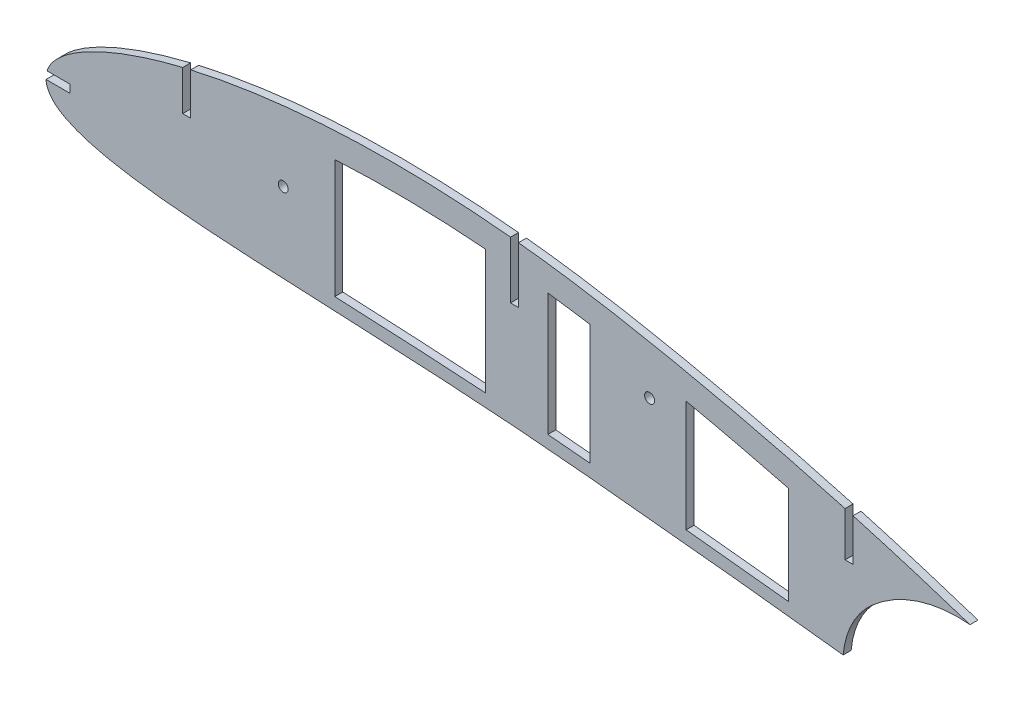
ISO-10303-21;
HEADER;
FILE_DESCRIPTION(('STEP AP214'),'2;1');
FILE_NAME('part.step','',(''),(''),'','','');
FILE_SCHEMA(('AUTOMOTIVE_DESIGN { 1 0 10303 214 1 1 1 1 }'));
ENDSEC;
DATA;
#1=APPLICATION_CONTEXT('core data for automotive mechanical design processes');
#2=APPLICATION_PROTOCOL_DEFINITION('international standard','automotive_design',2000,#1);
#3=PRODUCT_CONTEXT('',#1,'mechanical');
#4=PRODUCT('Part','Part','',(#3));
#5=PRODUCT_RELATED_PRODUCT_CATEGORY('part','',(#4));
#6=PRODUCT_DEFINITION_FORMATION('','',#4);
#7=PRODUCT_DEFINITION_CONTEXT('part definition',#1,'design');
#8=PRODUCT_DEFINITION('design','',#6,#7);
#9=PRODUCT_DEFINITION_SHAPE('','',#8);
#10=(LENGTH_UNIT() NAMED_UNIT(*) SI_UNIT(.MILLI.,.METRE.));
#11=(NAMED_UNIT(*) PLANE_ANGLE_UNIT() SI_UNIT($,.RADIAN.));
#12=(NAMED_UNIT(*) SI_UNIT($,.STERADIAN.) SOLID_ANGLE_UNIT());
#13=UNCERTAINTY_MEASURE_WITH_UNIT(LENGTH_MEASURE(1.E-05),#10,'distance_accuracy_value','');
#14=(GEOMETRIC_REPRESENTATION_CONTEXT(3) GLOBAL_UNCERTAINTY_ASSIGNED_CONTEXT((#13)) GLOBAL_UNIT_ASSIGNED_CONTEXT((#10,
#11,#12)) REPRESENTATION_CONTEXT('',''));
#15=CARTESIAN_POINT('',(0.,0.,0.));
#16=DIRECTION('',(0.,0.,1.));
#17=DIRECTION('',(1.,0.,0.));
#18=AXIS2_PLACEMENT_3D('',#15,#16,#17);
#19=CARTESIAN_POINT('',(533.4,-74.964481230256,476.25));
#20=CARTESIAN_POINT('',(533.393468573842,-74.3592932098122,476.25));
#21=CARTESIAN_POINT('',(531.326375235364,-72.9726299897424,476.25));
#22=CARTESIAN_POINT('',(527.400147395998,-71.2980390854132,476.25));
#23=CARTESIAN_POINT('',(520.602221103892,-67.7648945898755,476.25));
#24=CARTESIAN_POINT('',(511.347792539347,-63.3267299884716,476.25));
#25=CARTESIAN_POINT('',(499.502755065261,-57.6778186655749,476.25));
#26=CARTESIAN_POINT('',(485.246764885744,-51.1384096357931,476.25));
#27=CARTESIAN_POINT('',(468.676978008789,-43.8036364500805,476.25));
#28=CARTESIAN_POINT('',(449.947936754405,-35.8757202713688,476.25));
#29=CARTESIAN_POINT('',(429.230598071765,-27.5332286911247,476.25));
#30=CARTESIAN_POINT('',(406.718257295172,-18.9792879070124,476.25));
#31=CARTESIAN_POINT('',(382.640885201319,-10.382344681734,476.25));
#32=CARTESIAN_POINT('',(357.234331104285,-1.94698223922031,476.25));
#33=CARTESIAN_POINT('',(330.760171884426,6.14483374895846,476.25));
#34=CARTESIAN_POINT('',(303.50010629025,13.7381782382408,476.25));
#35=CARTESIAN_POINT('',(275.749595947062,20.6681404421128,476.25));
#36=CARTESIAN_POINT('',(247.797497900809,26.795319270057,476.25));
#37=CARTESIAN_POINT('',(219.77579834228,32.1343026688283,476.25));
#38=CARTESIAN_POINT('',(191.912986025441,36.1053653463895,476.25));
#39=CARTESIAN_POINT('',(164.569256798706,38.4384325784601,476.25));
#40=CARTESIAN_POINT('',(138.326668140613,39.1929872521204,476.25));
#41=CARTESIAN_POINT('',(113.549606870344,38.4856846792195,476.25));
#42=CARTESIAN_POINT('',(90.5807469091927,36.4479003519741,476.25));
#43=CARTESIAN_POINT('',(69.7330173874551,33.2891377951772,476.25));
#44=CARTESIAN_POINT('',(51.2766476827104,29.241370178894,476.25));
#45=CARTESIAN_POINT('',(35.4362610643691,24.539415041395,476.25));
#46=CARTESIAN_POINT('',(22.3884874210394,19.4234784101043,476.25));
#47=CARTESIAN_POINT('',(12.2196962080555,14.1253370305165,476.25));
#48=CARTESIAN_POINT('',(4.99901469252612,8.78084818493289,476.25));
#49=CARTESIAN_POINT('',(0.528637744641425,3.39704674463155,476.25));
#50=CARTESIAN_POINT('',(-0.609774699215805,-2.47889500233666,476.25));
#51=CARTESIAN_POINT('',(2.2546949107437,-7.70032156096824,476.25));
#52=CARTESIAN_POINT('',(8.00374597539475,-11.5081485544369,476.25));
#53=CARTESIAN_POINT('',(16.1982900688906,-14.6095937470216,476.25));
#54=CARTESIAN_POINT('',(26.9584985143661,-17.1149449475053,476.25));
#55=CARTESIAN_POINT('',(40.1607249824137,-19.119889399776,476.25));
#56=CARTESIAN_POINT('',(55.6666229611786,-20.6931815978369,476.25));
#57=CARTESIAN_POINT('',(73.2848054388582,-21.9411220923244,476.25));
#58=CARTESIAN_POINT('',(92.8177540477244,-22.9728124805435,476.25));
#59=CARTESIAN_POINT('',(114.052803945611,-23.9452202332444,476.25));
#60=CARTESIAN_POINT('',(136.779007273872,-24.9935512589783,476.25));
#61=CARTESIAN_POINT('',(160.778166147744,-26.2653553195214,476.25));
#62=CARTESIAN_POINT('',(185.828467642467,-27.915792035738,476.25));
#63=CARTESIAN_POINT('',(211.89529547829,-30.1378921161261,476.25));
#64=CARTESIAN_POINT('',(238.754061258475,-32.8568494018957,476.25));
#65=CARTESIAN_POINT('',(266.18062536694,-35.6241165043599,476.25));
#66=CARTESIAN_POINT('',(293.670265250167,-38.5940579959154,476.25));
#67=CARTESIAN_POINT('',(320.914949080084,-41.7432849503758,476.25));
#68=CARTESIAN_POINT('',(347.620557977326,-45.0642539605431,476.25));
#69=CARTESIAN_POINT('',(373.491842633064,-48.5288730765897,476.25));
#70=CARTESIAN_POINT('',(398.242667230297,-52.0819020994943,476.25));
#71=CARTESIAN_POINT('',(421.599418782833,-55.6440146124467,476.25));
#72=CARTESIAN_POINT('',(443.29349060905,-59.1670522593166,476.25));
#73=CARTESIAN_POINT('',(463.083690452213,-62.5183563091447,476.25));
#74=CARTESIAN_POINT('',(480.742383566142,-65.6572438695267,476.25));
#75=CARTESIAN_POINT('',(496.042405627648,-68.4378938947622,476.25));
#76=CARTESIAN_POINT('',(508.873832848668,-70.9319094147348,476.25));
#77=CARTESIAN_POINT('',(518.888745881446,-72.641498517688,476.25));
#78=CARTESIAN_POINT('',(526.44030087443,-74.6129246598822,476.25));
#79=CARTESIAN_POINT('',(530.448180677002,-74.5383148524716,476.25));
#80=CARTESIAN_POINT('',(533.132177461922,-76.0695207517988,476.25));
#81=CARTESIAN_POINT('',(533.402547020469,-75.2004827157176,476.25));
#82=CARTESIAN_POINT('',(533.4,-74.964481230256,476.25));
#83=B_SPLINE_CURVE_WITH_KNOTS('',3,(#19,#20,#21,#22,#23,#24,#25,#26,#27,#28,#29,#30,#31,#32,#33,
#34,#35,#36,#37,#38,#39,#40,#41,#42,#43,#44,#45,#46,#47,#48,#49,#50,#51,#52,#53,#54,#55,#56,#57,
#58,#59,#60,#61,#62,#63,#64,#65,#66,#67,#68,#69,#70,#71,#72,#73,#74,#75,#76,#77,#78,#79,#80,#81,
#82),.UNSPECIFIED.,.T.,.F.,(4,1,1,1,1,1,1,1,1,1,1,1,1,1,1,1,1,1,1,1,1,1,1,1,1,1,1,1,1,1,1,1,1,1,
1,1,1,1,1,1,1,1,1,1,1,1,1,1,1,1,1,1,1,1,1,1,1,1,1,1,1,4),(0.,0.00157509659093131,
0.00566746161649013,0.0124361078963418,0.0218013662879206,0.0336583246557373,0.0478653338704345,
0.0642720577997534,0.0826832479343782,0.102902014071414,0.124705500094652,0.147849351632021,
0.17208133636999,0.197142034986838,0.222755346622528,0.248649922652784,0.274532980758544,
0.300183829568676,0.325827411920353,0.35065745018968,0.37440722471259,0.396834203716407,
0.417695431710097,0.436768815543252,0.45385571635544,0.46878827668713,0.481435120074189,
0.491734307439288,0.499717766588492,0.505647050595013,0.510284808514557,0.51492307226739,
0.520799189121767,0.528612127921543,0.538559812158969,0.550634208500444,0.564731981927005,
0.580723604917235,0.598426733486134,0.617662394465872,0.638248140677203,0.659991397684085,
0.682696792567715,0.70618055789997,0.730782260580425,0.755750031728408,0.780776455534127,
0.805604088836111,0.829967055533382,0.853600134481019,0.876238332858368,0.897630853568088,
0.917536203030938,0.935711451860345,0.951952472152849,0.966054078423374,0.977844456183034,
0.987176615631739,0.993932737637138,0.998018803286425,0.999385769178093,1.),.UNSPECIFIED.);
#84=DIRECTION('',(0.,0.,-1.));
#85=VECTOR('',#84,1.);
#86=SURFACE_OF_LINEAR_EXTRUSION('',#83,#85);
#87=CARTESIAN_POINT('',(317.700957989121,-41.3989472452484,243.125000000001));
#88=CARTESIAN_POINT('',(309.717128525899,-40.4494478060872,243.125000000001));
#89=CARTESIAN_POINT('',(292.542202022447,-38.47218365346,243.125000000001));
#90=CARTESIAN_POINT('',(266.18062536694,-35.6241165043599,243.125000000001));
#91=CARTESIAN_POINT('',(238.754061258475,-32.8568494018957,243.125000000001));
#92=CARTESIAN_POINT('',(211.89529547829,-30.1378921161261,243.125000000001));
#93=CARTESIAN_POINT('',(185.828467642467,-27.915792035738,243.125000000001));
#94=CARTESIAN_POINT('',(160.778166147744,-26.2653553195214,243.125000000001));
#95=CARTESIAN_POINT('',(136.779007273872,-24.9935512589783,243.125000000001));
#96=CARTESIAN_POINT('',(114.052803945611,-23.9452202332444,243.125000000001));
#97=CARTESIAN_POINT('',(92.8177540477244,-22.9728124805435,243.125000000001));
#98=CARTESIAN_POINT('',(73.2848054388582,-21.9411220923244,243.125000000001));
#99=CARTESIAN_POINT('',(55.6666229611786,-20.6931815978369,243.125000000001));
#100=CARTESIAN_POINT('',(40.1607249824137,-19.119889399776,243.125000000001));
#101=CARTESIAN_POINT('',(26.9584985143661,-17.1149449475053,243.125000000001));
#102=CARTESIAN_POINT('',(16.1982900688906,-14.6095937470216,243.125000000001));
#103=CARTESIAN_POINT('',(8.00374597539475,-11.5081485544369,243.125000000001));
#104=CARTESIAN_POINT('',(2.2546949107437,-7.70032156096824,243.125000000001));
#105=CARTESIAN_POINT('',(0.13108127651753,-3.82934572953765,243.125000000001));
#106=CARTESIAN_POINT('',(-0.0651446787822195,-1.85383126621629,243.125000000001));
#107=CARTESIAN_POINT('',(-0.0777929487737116,-1.58749999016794,243.125000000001));
#108=B_SPLINE_CURVE_WITH_KNOTS('',3,(#87,#88,#89,#90,#91,#92,#93,#94,#95,#96,#97,#98,#99,#100,
#101,#102,#103,#104,#105,#106,#107),.UNSPECIFIED.,.F.,.F.,(4,1,1,1,1,1,1,1,1,1,1,1,1,1,1,1,1,1,
4),(0.509565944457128,0.531323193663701,0.556349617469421,0.581317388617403,0.605919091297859,
0.629402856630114,0.652108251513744,0.673851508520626,0.694437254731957,0.713672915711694,
0.731376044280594,0.747367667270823,0.761465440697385,0.77353983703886,0.783487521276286,
0.791300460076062,0.797176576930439,0.801814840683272,0.802533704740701),.UNSPECIFIED.);
#109=CARTESIAN_POINT('',(-0.0777929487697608,-1.5875,243.125));
#110=VERTEX_POINT('',#109);
#111=CARTESIAN_POINT('',(317.700957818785,-41.3989482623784,243.12500511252));
#112=VERTEX_POINT('',#111);
#113=EDGE_CURVE('E502',#110,#112,#108,.F.);
#114=ORIENTED_EDGE('',*,*,#113,.F.);
#115=DIRECTION('',(0.,0.,-1.));
#116=VECTOR('',#115,1.);
#117=CARTESIAN_POINT('',(-0.077792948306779,-1.58750000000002,241.5375));
#118=LINE('',#117,#116);
#119=CARTESIAN_POINT('',(-0.077792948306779,-1.58750000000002,239.95));
#120=VERTEX_POINT('',#119);
#121=EDGE_CURVE('E57',#110,#120,#118,.T.);
#122=ORIENTED_EDGE('',*,*,#121,.T.);
#123=CARTESIAN_POINT('',(533.4,-74.964481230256,239.95));
#124=CARTESIAN_POINT('',(533.393468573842,-74.3592932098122,239.95));
#125=CARTESIAN_POINT('',(531.326375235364,-72.9726299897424,239.95));
#126=CARTESIAN_POINT('',(527.400147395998,-71.2980390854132,239.95));
#127=CARTESIAN_POINT('',(520.602221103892,-67.7648945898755,239.95));
#128=CARTESIAN_POINT('',(511.347792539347,-63.3267299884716,239.95));
#129=CARTESIAN_POINT('',(499.502755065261,-57.6778186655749,239.95));
#130=CARTESIAN_POINT('',(485.246764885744,-51.1384096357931,239.95));
#131=CARTESIAN_POINT('',(468.676978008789,-43.8036364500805,239.95));
#132=CARTESIAN_POINT('',(449.947936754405,-35.8757202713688,239.95));
#133=CARTESIAN_POINT('',(429.230598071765,-27.5332286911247,239.95));
#134=CARTESIAN_POINT('',(406.718257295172,-18.9792879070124,239.95));
#135=CARTESIAN_POINT('',(382.640885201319,-10.382344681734,239.95));
#136=CARTESIAN_POINT('',(357.234331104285,-1.94698223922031,239.95));
#137=CARTESIAN_POINT('',(330.760171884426,6.14483374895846,239.95));
#138=CARTESIAN_POINT('',(303.50010629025,13.7381782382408,239.95));
#139=CARTESIAN_POINT('',(275.749595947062,20.6681404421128,239.95));
#140=CARTESIAN_POINT('',(247.797497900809,26.795319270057,239.95));
#141=CARTESIAN_POINT('',(219.77579834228,32.1343026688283,239.95));
#142=CARTESIAN_POINT('',(191.912986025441,36.1053653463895,239.95));
#143=CARTESIAN_POINT('',(164.569256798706,38.4384325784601,239.95));
#144=CARTESIAN_POINT('',(138.326668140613,39.1929872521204,239.95));
#145=CARTESIAN_POINT('',(113.549606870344,38.4856846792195,239.95));
#146=CARTESIAN_POINT('',(90.5807469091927,36.4479003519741,239.95));
#147=CARTESIAN_POINT('',(69.7330173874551,33.2891377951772,239.95));
#148=CARTESIAN_POINT('',(51.2766476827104,29.241370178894,239.95));
#149=CARTESIAN_POINT('',(35.4362610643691,24.539415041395,239.95));
#150=CARTESIAN_POINT('',(22.3884874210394,19.4234784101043,239.95));
#151=CARTESIAN_POINT('',(12.2196962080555,14.1253370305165,239.95));
#152=CARTESIAN_POINT('',(4.99901469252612,8.78084818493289,239.95));
#153=CARTESIAN_POINT('',(0.528637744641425,3.39704674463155,239.95));
#154=CARTESIAN_POINT('',(-0.609774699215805,-2.47889500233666,239.95));
#155=CARTESIAN_POINT('',(2.2546949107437,-7.70032156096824,239.95));
#156=CARTESIAN_POINT('',(8.00374597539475,-11.5081485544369,239.95));
#157=CARTESIAN_POINT('',(16.1982900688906,-14.6095937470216,239.95));
#158=CARTESIAN_POINT('',(26.9584985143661,-17.1149449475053,239.95));
#159=CARTESIAN_POINT('',(40.1607249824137,-19.119889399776,239.95));
#160=CARTESIAN_POINT('',(55.6666229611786,-20.6931815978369,239.95));
#161=CARTESIAN_POINT('',(73.2848054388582,-21.9411220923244,239.95));
#162=CARTESIAN_POINT('',(92.8177540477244,-22.9728124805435,239.95));
#163=CARTESIAN_POINT('',(114.052803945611,-23.9452202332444,239.95));
#164=CARTESIAN_POINT('',(136.779007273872,-24.9935512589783,239.95));
#165=CARTESIAN_POINT('',(160.778166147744,-26.2653553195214,239.95));
#166=CARTESIAN_POINT('',(185.828467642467,-27.915792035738,239.95));
#167=CARTESIAN_POINT('',(211.89529547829,-30.1378921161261,239.95));
#168=CARTESIAN_POINT('',(238.754061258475,-32.8568494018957,239.95));
#169=CARTESIAN_POINT('',(266.18062536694,-35.6241165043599,239.95));
#170=CARTESIAN_POINT('',(293.670265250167,-38.5940579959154,239.95));
#171=CARTESIAN_POINT('',(320.914949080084,-41.7432849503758,239.95));
#172=CARTESIAN_POINT('',(347.620557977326,-45.0642539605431,239.95));
#173=CARTESIAN_POINT('',(373.491842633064,-48.5288730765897,239.95));
#174=CARTESIAN_POINT('',(398.242667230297,-52.0819020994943,239.95));
#175=CARTESIAN_POINT('',(421.599418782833,-55.6440146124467,239.95));
#176=CARTESIAN_POINT('',(443.29349060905,-59.1670522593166,239.95));
#177=CARTESIAN_POINT('',(463.083690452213,-62.5183563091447,239.95));
#178=CARTESIAN_POINT('',(480.742383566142,-65.6572438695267,239.95));
#179=CARTESIAN_POINT('',(496.042405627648,-68.4378938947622,239.95));
#180=CARTESIAN_POINT('',(508.873832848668,-70.9319094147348,239.95));
#181=CARTESIAN_POINT('',(518.888745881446,-72.641498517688,239.95));
#182=CARTESIAN_POINT('',(526.44030087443,-74.6129246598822,239.95));
#183=CARTESIAN_POINT('',(530.448180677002,-74.5383148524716,239.95));
#184=CARTESIAN_POINT('',(533.132177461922,-76.0695207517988,239.95));
#185=CARTESIAN_POINT('',(533.402547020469,-75.2004827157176,239.95));
#186=CARTESIAN_POINT('',(533.4,-74.964481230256,239.95));
#187=B_SPLINE_CURVE_WITH_KNOTS('',3,(#123,#124,#125,#126,#127,#128,#129,#130,#131,#132,#133,
#134,#135,#136,#137,#138,#139,#140,#141,#142,#143,#144,#145,#146,#147,#148,#149,#150,#151,#152,
#153,#154,#155,#156,#157,#158,#159,#160,#161,#162,#163,#164,#165,#166,#167,#168,#169,#170,#171,
#172,#173,#174,#175,#176,#177,#178,#179,#180,#181,#182,#183,#184,#185,#186),.UNSPECIFIED.,.T.,
.F.,(4,1,1,1,1,1,1,1,1,1,1,1,1,1,1,1,1,1,1,1,1,1,1,1,1,1,1,1,1,1,1,1,1,1,1,1,1,1,1,1,1,1,1,1,1,
1,1,1,1,1,1,1,1,1,1,1,1,1,1,1,1,4),(0.,0.00157509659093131,0.00566746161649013,
0.0124361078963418,0.0218013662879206,0.0336583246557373,0.0478653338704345,0.0642720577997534,
0.0826832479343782,0.102902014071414,0.124705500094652,0.147849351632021,0.17208133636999,
0.197142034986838,0.222755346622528,0.248649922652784,0.274532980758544,0.300183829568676,
0.325827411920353,0.35065745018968,0.37440722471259,0.396834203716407,0.417695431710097,
0.436768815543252,0.45385571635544,0.46878827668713,0.481435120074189,0.491734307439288,
0.499717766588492,0.505647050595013,0.510284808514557,0.51492307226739,0.520799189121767,
0.528612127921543,0.538559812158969,0.550634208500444,0.564731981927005,0.580723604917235,
0.598426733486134,0.617662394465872,0.638248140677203,0.659991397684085,0.682696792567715,
0.70618055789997,0.730782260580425,0.755750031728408,0.780776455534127,0.805604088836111,
0.829967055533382,0.853600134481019,0.876238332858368,0.897630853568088,0.917536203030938,
0.935711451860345,0.951952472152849,0.966054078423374,0.977844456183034,0.987176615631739,
0.993932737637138,0.998018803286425,0.999385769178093,1.),.UNSPECIFIED.);
#188=CARTESIAN_POINT('',(317.700957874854,-41.3989472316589,239.95));
#189=VERTEX_POINT('',#188);
#190=EDGE_CURVE('E651',#189,#120,#187,.F.);
#191=ORIENTED_EDGE('',*,*,#190,.F.);
#192=DIRECTION('',(0.,0.,1.));
#193=VECTOR('',#192,1.);
#194=CARTESIAN_POINT('',(317.700957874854,-41.3989472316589,238.125));
#195=LINE('',#194,#193);
#196=EDGE_CURVE('E537',#189,#112,#195,.T.);
#197=ORIENTED_EDGE('',*,*,#196,.T.);
#198=EDGE_LOOP('',(#114,#122,#191,#197));
#199=FACE_BOUND('',#198,.T.);
#200=ADVANCED_FACE('F47',(#199),#86,.F.);
#201=CARTESIAN_POINT('',(4.42497203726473,7.78722275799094,243.125));
#202=DIRECTION('',(0.,0.,-1.));
#203=DIRECTION('',(-1.,0.,0.));
#204=AXIS2_PLACEMENT_3D('',#201,#202,#203);
#205=PLANE('',#204);
#206=DIRECTION('',(0.,-1.,0.));
#207=VECTOR('',#206,1.);
#208=CARTESIAN_POINT('',(295.885402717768,7.98040633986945E-12,243.125));
#209=LINE('',#208,#207);
#210=CARTESIAN_POINT('',(295.885402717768,5.26018954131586,243.125));
#211=VERTEX_POINT('',#210);
#212=CARTESIAN_POINT('',(295.885402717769,-33.8448176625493,243.125));
#213=VERTEX_POINT('',#212);
#214=EDGE_CURVE('E284',#211,#213,#209,.T.);
#215=ORIENTED_EDGE('',*,*,#214,.T.);
#216=CARTESIAN_POINT('',(255.083501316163,-29.4853961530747,243.125));
#217=CARTESIAN_POINT('',(259.958693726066,-29.9833232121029,243.125));
#218=CARTESIAN_POINT('',(264.834987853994,-30.4864967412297,243.125));
#219=CARTESIAN_POINT('',(278.438821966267,-31.9183101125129,243.125));
#220=CARTESIAN_POINT('',(287.163571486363,-32.865541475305,243.125));
#221=CARTESIAN_POINT('',(295.885402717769,-33.8448176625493,243.125));
#222=B_SPLINE_CURVE_WITH_KNOTS('',3,(#216,#217,#218,#219,#220,#221),.UNSPECIFIED.,.F.,.F.,(4,2,
4),(0.83738231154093,0.874999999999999,0.942328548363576),.UNSPECIFIED.);
#223=CARTESIAN_POINT('',(255.083501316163,-29.4853961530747,243.125));
#224=VERTEX_POINT('',#223);
#225=EDGE_CURVE('E365',#224,#213,#222,.T.);
#226=ORIENTED_EDGE('',*,*,#225,.F.);
#227=DIRECTION('',(0.,-1.,0.));
#228=VECTOR('',#227,1.);
#229=CARTESIAN_POINT('',(255.083501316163,3.18907619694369E-13,243.125));
#230=LINE('',#229,#228);
#231=CARTESIAN_POINT('',(255.083501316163,14.9161105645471,243.125));
#232=VERTEX_POINT('',#231);
#233=EDGE_CURVE('E377',#232,#224,#230,.T.);
#234=ORIENTED_EDGE('',*,*,#233,.F.);
#235=CARTESIAN_POINT('',(295.885402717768,5.26018954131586,243.125));
#236=CARTESIAN_POINT('',(291.896936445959,6.29213010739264,243.125));
#237=CARTESIAN_POINT('',(287.902858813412,7.30013473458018,243.125));
#238=CARTESIAN_POINT('',(274.329260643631,10.6374053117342,243.125));
#239=CARTESIAN_POINT('',(264.72342374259,12.8472029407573,243.125));
#240=CARTESIAN_POINT('',(255.083501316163,14.9161105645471,243.125));
#241=B_SPLINE_CURVE_WITH_KNOTS('',3,(#235,#236,#237,#238,#239,#240),.UNSPECIFIED.,.F.,.F.,(4,2,
4),(0.156190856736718,0.25,0.474560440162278),.UNSPECIFIED.);
#242=EDGE_CURVE('E374',#211,#232,#241,.T.);
#243=ORIENTED_EDGE('',*,*,#242,.F.);
#244=EDGE_LOOP('',(#215,#226,#234,#243));
#245=FACE_BOUND('',#244,.T.);
#246=CARTESIAN_POINT('',(115.041570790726,-18.9869084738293,243.125));
#247=CARTESIAN_POINT('',(117.847998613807,-19.115874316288,243.125));
#248=CARTESIAN_POINT('',(120.655236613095,-19.2451303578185,243.125));
#249=CARTESIAN_POINT('',(139.72813443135,-20.1353078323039,243.125));
#250=CARTESIAN_POINT('',(156.014765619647,-20.9556888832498,243.125));
#251=CARTESIAN_POINT('',(173.219283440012,-22.0907101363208,243.125));
#252=CARTESIAN_POINT('',(174.136009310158,-22.151982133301,243.125));
#253=CARTESIAN_POINT('',(175.05273633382,-22.214079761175,243.125));
#254=B_SPLINE_CURVE_WITH_KNOTS('',3,(#246,#247,#248,#249,#250,#251,#252,#253),.UNSPECIFIED.,.F.,
.F.,(4,2,2,4),(0.478421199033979,0.499999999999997,0.624999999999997,0.63203533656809),.UNSPECIFIED.);
#255=CARTESIAN_POINT('',(115.041570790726,-18.9869084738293,243.125));
#256=VERTEX_POINT('',#255);
#257=CARTESIAN_POINT('',(175.05273633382,-22.214079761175,243.125));
#258=VERTEX_POINT('',#257);
#259=EDGE_CURVE('E1116',#256,#258,#254,.T.);
#260=ORIENTED_EDGE('',*,*,#259,.F.);
#261=DIRECTION('',(0.,-1.,0.));
#262=VECTOR('',#261,1.);
#263=CARTESIAN_POINT('',(115.041570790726,0.,243.125));
#264=LINE('',#263,#262);
#265=CARTESIAN_POINT('',(115.041570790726,28.314319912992,243.125));
#266=VERTEX_POINT('',#265);
#267=EDGE_CURVE('E765',#266,#256,#264,.T.);
#268=ORIENTED_EDGE('',*,*,#267,.F.);
#269=CARTESIAN_POINT('',(175.052736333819,27.437925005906,243.125));
#270=CARTESIAN_POINT('',(167.64436416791,28.0370437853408,243.125));
#271=CARTESIAN_POINT('',(160.224444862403,28.4621916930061,243.125));
#272=CARTESIAN_POINT('',(142.356458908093,29.0497297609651,243.125));
#273=CARTESIAN_POINT('',(131.904498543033,29.0355302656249,243.125));
#274=CARTESIAN_POINT('',(119.337632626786,28.5367679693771,243.125));
#275=CARTESIAN_POINT('',(117.188700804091,28.4343453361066,243.125));
#276=CARTESIAN_POINT('',(115.041570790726,28.314319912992,243.125));
#277=B_SPLINE_CURVE_WITH_KNOTS('',3,(#269,#270,#271,#272,#273,#274,#275,#276),.UNSPECIFIED.,.F.,
.F.,(4,2,2,4),(0.0724048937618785,0.25,0.5,0.551608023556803),.UNSPECIFIED.);
#278=CARTESIAN_POINT('',(175.052736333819,27.437925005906,243.125));
#279=VERTEX_POINT('',#278);
#280=EDGE_CURVE('E1108',#279,#266,#277,.T.);
#281=ORIENTED_EDGE('',*,*,#280,.F.);
#282=DIRECTION('',(0.,-1.,0.));
#283=VECTOR('',#282,1.);
#284=CARTESIAN_POINT('',(175.052736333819,2.05495184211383E-12,243.125));
#285=LINE('',#284,#283);
#286=EDGE_CURVE('E1111',#279,#258,#285,.T.);
#287=ORIENTED_EDGE('',*,*,#286,.T.);
#288=EDGE_LOOP('',(#260,#268,#281,#287));
#289=FACE_BOUND('',#288,.T.);
#290=CARTESIAN_POINT('',(94.488,8.72347895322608,243.125));
#291=DIRECTION('',(0.,0.,-1.));
#292=DIRECTION('',(-1.,0.,0.));
#293=AXIS2_PLACEMENT_3D('',#290,#291,#292);
#294=CIRCLE('',#293,1.9812);
#295=CARTESIAN_POINT('',(92.5068,8.72347895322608,243.125));
#296=VERTEX_POINT('',#295);
#297=EDGE_CURVE('E478',#296,#296,#294,.F.);
#298=ORIENTED_EDGE('',*,*,#297,.F.);
#299=EDGE_LOOP('',(#298));
#300=FACE_BOUND('',#299,.T.);
#301=DIRECTION('',(0.,1.,0.));
#302=VECTOR('',#301,1.);
#303=CARTESIAN_POINT('',(9.52500000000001,-1.5875,243.125));
#304=LINE('',#303,#302);
#305=CARTESIAN_POINT('',(9.52500000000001,-1.5875,243.125));
#306=VERTEX_POINT('',#305);
#307=CARTESIAN_POINT('',(9.52500000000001,1.5875,243.125));
#308=VERTEX_POINT('',#307);
#309=EDGE_CURVE('E261',#306,#308,#304,.T.);
#310=ORIENTED_EDGE('',*,*,#309,.F.);
#311=DIRECTION('',(1.,0.,0.));
#312=VECTOR('',#311,1.);
#313=CARTESIAN_POINT('',(-9.525,-1.5875,243.125));
#314=LINE('',#313,#312);
#315=EDGE_CURVE('E258',#110,#306,#314,.T.);
#316=ORIENTED_EDGE('',*,*,#315,.F.);
#317=ORIENTED_EDGE('',*,*,#113,.T.);
#318=CARTESIAN_POINT('',(352.295677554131,-44.3928180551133,243.125));
#319=DIRECTION('',(0.,0.,-1.));
#320=DIRECTION('',(-1.,0.,0.));
#321=AXIS2_PLACEMENT_3D('',#318,#319,#320);
#322=CIRCLE('',#321,34.7240247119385);
#323=CARTESIAN_POINT('',(329.27302606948,-18.3982915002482,243.125));
#324=VERTEX_POINT('',#323);
#325=EDGE_CURVE('E536',#112,#324,#322,.T.);
#326=ORIENTED_EDGE('',*,*,#325,.T.);
#327=CARTESIAN_POINT('',(363.499909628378,-57.0433465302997,243.125));
#328=DIRECTION('',(0.,0.,-1.));
#329=DIRECTION('',(-1.,0.,0.));
#330=AXIS2_PLACEMENT_3D('',#327,#328,#329);
#331=CIRCLE('',#330,51.6228615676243);
#332=CARTESIAN_POINT('',(368.273307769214,-5.64164902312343,243.125006));
#333=VERTEX_POINT('',#332);
#334=EDGE_CURVE('E533',#333,#324,#331,.F.);
#335=ORIENTED_EDGE('',*,*,#334,.F.);
#336=CARTESIAN_POINT('',(533.4,-74.964481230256,243.125));
#337=CARTESIAN_POINT('',(533.393468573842,-74.3592932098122,243.125));
#338=CARTESIAN_POINT('',(531.326375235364,-72.9726299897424,243.125));
#339=CARTESIAN_POINT('',(527.400147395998,-71.2980390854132,243.125));
#340=CARTESIAN_POINT('',(520.602221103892,-67.7648945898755,243.125));
#341=CARTESIAN_POINT('',(511.347792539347,-63.3267299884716,243.125));
#342=CARTESIAN_POINT('',(499.502755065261,-57.6778186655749,243.125));
#343=CARTESIAN_POINT('',(485.246764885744,-51.1384096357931,243.125));
#344=CARTESIAN_POINT('',(468.676978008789,-43.8036364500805,243.125));
#345=CARTESIAN_POINT('',(449.947936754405,-35.8757202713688,243.125));
#346=CARTESIAN_POINT('',(429.230598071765,-27.5332286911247,243.125));
#347=CARTESIAN_POINT('',(406.718257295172,-18.9792879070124,243.125));
#348=CARTESIAN_POINT('',(382.640885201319,-10.382344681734,243.125));
#349=CARTESIAN_POINT('',(357.234331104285,-1.94698223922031,243.125));
#350=CARTESIAN_POINT('',(330.760171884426,6.14483374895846,243.125));
#351=CARTESIAN_POINT('',(303.50010629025,13.7381782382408,243.125));
#352=CARTESIAN_POINT('',(275.749595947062,20.6681404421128,243.125));
#353=CARTESIAN_POINT('',(247.797497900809,26.795319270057,243.125));
#354=CARTESIAN_POINT('',(219.77579834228,32.1343026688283,243.125));
#355=CARTESIAN_POINT('',(191.912986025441,36.1053653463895,243.125));
#356=CARTESIAN_POINT('',(164.569256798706,38.4384325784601,243.125));
#357=CARTESIAN_POINT('',(138.326668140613,39.1929872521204,243.125));
#358=CARTESIAN_POINT('',(113.549606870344,38.4856846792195,243.125));
#359=CARTESIAN_POINT('',(90.5807469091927,36.4479003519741,243.125));
#360=CARTESIAN_POINT('',(69.7330173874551,33.2891377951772,243.125));
#361=CARTESIAN_POINT('',(51.2766476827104,29.241370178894,243.125));
#362=CARTESIAN_POINT('',(35.4362610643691,24.539415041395,243.125));
#363=CARTESIAN_POINT('',(22.3884874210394,19.4234784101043,243.125));
#364=CARTESIAN_POINT('',(12.2196962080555,14.1253370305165,243.125));
#365=CARTESIAN_POINT('',(4.99901469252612,8.78084818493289,243.125));
#366=CARTESIAN_POINT('',(0.528637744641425,3.39704674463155,243.125));
#367=CARTESIAN_POINT('',(-0.609774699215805,-2.47889500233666,243.125));
#368=CARTESIAN_POINT('',(2.2546949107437,-7.70032156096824,243.125));
#369=CARTESIAN_POINT('',(8.00374597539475,-11.5081485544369,243.125));
#370=CARTESIAN_POINT('',(16.1982900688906,-14.6095937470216,243.125));
#371=CARTESIAN_POINT('',(26.9584985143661,-17.1149449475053,243.125));
#372=CARTESIAN_POINT('',(40.1607249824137,-19.119889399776,243.125));
#373=CARTESIAN_POINT('',(55.6666229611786,-20.6931815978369,243.125));
#374=CARTESIAN_POINT('',(73.2848054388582,-21.9411220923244,243.125));
#375=CARTESIAN_POINT('',(92.8177540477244,-22.9728124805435,243.125));
#376=CARTESIAN_POINT('',(114.052803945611,-23.9452202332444,243.125));
#377=CARTESIAN_POINT('',(136.779007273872,-24.9935512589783,243.125));
#378=CARTESIAN_POINT('',(160.778166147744,-26.2653553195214,243.125));
#379=CARTESIAN_POINT('',(185.828467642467,-27.915792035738,243.125));
#380=CARTESIAN_POINT('',(211.89529547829,-30.1378921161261,243.125));
#381=CARTESIAN_POINT('',(238.754061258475,-32.8568494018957,243.125));
#382=CARTESIAN_POINT('',(266.18062536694,-35.6241165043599,243.125));
#383=CARTESIAN_POINT('',(293.670265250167,-38.5940579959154,243.125));
#384=CARTESIAN_POINT('',(320.914949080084,-41.7432849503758,243.125));
#385=CARTESIAN_POINT('',(347.620557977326,-45.0642539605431,243.125));
#386=CARTESIAN_POINT('',(373.491842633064,-48.5288730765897,243.125));
#387=CARTESIAN_POINT('',(398.242667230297,-52.0819020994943,243.125));
#388=CARTESIAN_POINT('',(421.599418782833,-55.6440146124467,243.125));
#389=CARTESIAN_POINT('',(443.29349060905,-59.1670522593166,243.125));
#390=CARTESIAN_POINT('',(463.083690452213,-62.5183563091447,243.125));
#391=CARTESIAN_POINT('',(480.742383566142,-65.6572438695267,243.125));
#392=CARTESIAN_POINT('',(496.042405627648,-68.4378938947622,243.125));
#393=CARTESIAN_POINT('',(508.873832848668,-70.9319094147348,243.125));
#394=CARTESIAN_POINT('',(518.888745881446,-72.641498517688,243.125));
#395=CARTESIAN_POINT('',(526.44030087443,-74.6129246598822,243.125));
#396=CARTESIAN_POINT('',(530.448180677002,-74.5383148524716,243.125));
#397=CARTESIAN_POINT('',(533.132177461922,-76.0695207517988,243.125));
#398=CARTESIAN_POINT('',(533.402547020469,-75.2004827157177,243.125));
#399=CARTESIAN_POINT('',(533.4,-74.964481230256,243.125));
#400=B_SPLINE_CURVE_WITH_KNOTS('',3,(#336,#337,#338,#339,#340,#341,#342,#343,#344,#345,#346,
#347,#348,#349,#350,#351,#352,#353,#354,#355,#356,#357,#358,#359,#360,#361,#362,#363,#364,#365,
#366,#367,#368,#369,#370,#371,#372,#373,#374,#375,#376,#377,#378,#379,#380,#381,#382,#383,#384,
#385,#386,#387,#388,#389,#390,#391,#392,#393,#394,#395,#396,#397,#398,#399),.UNSPECIFIED.,.T.,
.F.,(4,1,1,1,1,1,1,1,1,1,1,1,1,1,1,1,1,1,1,1,1,1,1,1,1,1,1,1,1,1,1,1,1,1,1,1,1,1,1,1,1,1,1,1,1,
1,1,1,1,1,1,1,1,1,1,1,1,1,1,1,1,4),(0.,0.00157509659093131,0.00566746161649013,
0.0124361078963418,0.0218013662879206,0.0336583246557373,0.0478653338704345,0.0642720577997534,
0.0826832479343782,0.102902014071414,0.124705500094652,0.147849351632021,0.17208133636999,
0.197142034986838,0.222755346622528,0.248649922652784,0.274532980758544,0.300183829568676,
0.325827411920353,0.35065745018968,0.37440722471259,0.396834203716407,0.417695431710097,
0.436768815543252,0.45385571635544,0.46878827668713,0.481435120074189,0.491734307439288,
0.499717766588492,0.505647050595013,0.510284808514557,0.51492307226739,0.520799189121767,
0.528612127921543,0.538559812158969,0.550634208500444,0.564731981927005,0.580723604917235,
0.598426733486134,0.617662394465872,0.638248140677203,0.659991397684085,0.682696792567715,
0.70618055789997,0.730782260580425,0.755750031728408,0.780776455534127,0.805604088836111,
0.829967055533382,0.853600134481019,0.876238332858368,0.897630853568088,0.917536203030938,
0.935711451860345,0.951952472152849,0.966054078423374,0.977844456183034,0.987176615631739,
0.993932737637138,0.998018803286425,0.999385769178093,1.),.UNSPECIFIED.);
#401=CARTESIAN_POINT('',(321.627500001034,8.64800941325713,243.125));
#402=VERTEX_POINT('',#401);
#403=EDGE_CURVE('E515',#333,#402,#400,.T.);
#404=ORIENTED_EDGE('',*,*,#403,.T.);
#405=DIRECTION('',(0.,-1.,0.));
#406=VECTOR('',#405,1.);
#407=CARTESIAN_POINT('',(321.627499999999,7.7872227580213,243.125));
#408=LINE('',#407,#406);
#409=CARTESIAN_POINT('',(321.6275,-8.16744704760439,243.125));
#410=VERTEX_POINT('',#409);
#411=EDGE_CURVE('E488',#402,#410,#408,.T.);
#412=ORIENTED_EDGE('',*,*,#411,.T.);
#413=DIRECTION('',(-1.,0.,0.));
#414=VECTOR('',#413,1.);
#415=CARTESIAN_POINT('',(4.42497203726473,-8.16744704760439,243.125));
#416=LINE('',#415,#414);
#417=CARTESIAN_POINT('',(318.4525,-8.16744704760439,243.125));
#418=VERTEX_POINT('',#417);
#419=EDGE_CURVE('E494',#410,#418,#416,.T.);
#420=ORIENTED_EDGE('',*,*,#419,.T.);
#421=DIRECTION('',(0.,1.,0.));
#422=VECTOR('',#421,1.);
#423=CARTESIAN_POINT('',(318.452499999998,7.78722275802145,243.125));
#424=LINE('',#423,#422);
#425=CARTESIAN_POINT('',(318.452499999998,9.54073651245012,243.125));
#426=VERTEX_POINT('',#425);
#427=EDGE_CURVE('E491',#418,#426,#424,.T.);
#428=ORIENTED_EDGE('',*,*,#427,.T.);
#429=CARTESIAN_POINT('',(188.277499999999,36.2413167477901,243.125));
#430=VERTEX_POINT('',#429);
#431=EDGE_CURVE('E507',#426,#430,#400,.T.);
#432=ORIENTED_EDGE('',*,*,#431,.T.);
#433=DIRECTION('',(0.,-1.,0.));
#434=VECTOR('',#433,1.);
#435=CARTESIAN_POINT('',(188.2775,7.78722275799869,243.125));
#436=LINE('',#435,#434);
#437=CARTESIAN_POINT('',(188.2775,13.8593727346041,243.125));
#438=VERTEX_POINT('',#437);
#439=EDGE_CURVE('E485',#430,#438,#436,.T.);
#440=ORIENTED_EDGE('',*,*,#439,.T.);
#441=DIRECTION('',(-1.,0.,0.));
#442=VECTOR('',#441,1.);
#443=CARTESIAN_POINT('',(4.42497203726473,13.8593727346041,243.125));
#444=LINE('',#443,#442);
#445=CARTESIAN_POINT('',(185.1025,13.8593727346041,243.125));
#446=VERTEX_POINT('',#445);
#447=EDGE_CURVE('E482',#438,#446,#444,.T.);
#448=ORIENTED_EDGE('',*,*,#447,.T.);
#449=DIRECTION('',(0.,1.,0.));
#450=VECTOR('',#449,1.);
#451=CARTESIAN_POINT('',(185.1025,7.78722275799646,243.125));
#452=LINE('',#451,#450);
#453=CARTESIAN_POINT('',(185.102499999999,36.5692474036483,243.125));
#454=VERTEX_POINT('',#453);
#455=EDGE_CURVE('E479',#446,#454,#452,.T.);
#456=ORIENTED_EDGE('',*,*,#455,.T.);
#457=CARTESIAN_POINT('',(57.5944999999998,30.5567205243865,243.125));
#458=VERTEX_POINT('',#457);
#459=EDGE_CURVE('E503',#454,#458,#400,.T.);
#460=ORIENTED_EDGE('',*,*,#459,.T.);
#461=DIRECTION('',(0.,-1.,0.));
#462=VECTOR('',#461,1.);
#463=CARTESIAN_POINT('',(57.5945,7.78722275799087,243.125));
#464=LINE('',#463,#462);
#465=CARTESIAN_POINT('',(57.5945,13.8593727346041,243.125));
#466=VERTEX_POINT('',#465);
#467=EDGE_CURVE('E452',#458,#466,#464,.T.);
#468=ORIENTED_EDGE('',*,*,#467,.T.);
#469=DIRECTION('',(-1.,0.,0.));
#470=VECTOR('',#469,1.);
#471=CARTESIAN_POINT('',(4.42497203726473,13.8593727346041,243.125));
#472=LINE('',#471,#470);
#473=CARTESIAN_POINT('',(54.4195,13.8593727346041,243.125));
#474=VERTEX_POINT('',#473);
#475=EDGE_CURVE('E499',#466,#474,#472,.T.);
#476=ORIENTED_EDGE('',*,*,#475,.T.);
#477=DIRECTION('',(0.,1.,0.));
#478=VECTOR('',#477,1.);
#479=CARTESIAN_POINT('',(54.4195,7.78722275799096,243.125));
#480=LINE('',#479,#478);
#481=CARTESIAN_POINT('',(54.4194999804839,29.8052641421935,243.125));
#482=VERTEX_POINT('',#481);
#483=EDGE_CURVE('E498',#474,#482,#480,.T.);
#484=ORIENTED_EDGE('',*,*,#483,.T.);
#485=CARTESIAN_POINT('',(0.358615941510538,1.58748977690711,243.125000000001));
#486=CARTESIAN_POINT('',(0.476183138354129,1.96684350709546,243.125000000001));
#487=CARTESIAN_POINT('',(1.39242084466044,4.4373251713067,243.125000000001));
#488=CARTESIAN_POINT('',(4.99901469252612,8.78084818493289,243.125000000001));
#489=CARTESIAN_POINT('',(12.2196962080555,14.1253370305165,243.125000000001));
#490=CARTESIAN_POINT('',(22.3884874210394,19.4234784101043,243.125000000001));
#491=CARTESIAN_POINT('',(35.4362610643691,24.539415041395,243.125000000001));
#492=CARTESIAN_POINT('',(46.4903395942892,27.820634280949,243.125000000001));
#493=CARTESIAN_POINT('',(53.1300160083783,29.4914545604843,243.125000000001));
#494=CARTESIAN_POINT('',(54.4194999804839,29.8052641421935,243.125000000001));
#495=B_SPLINE_CURVE_WITH_KNOTS('',3,(#485,#486,#487,#488,#489,#490,#491,#492,#493,#494),
.UNSPECIFIED.,.F.,.F.,(4,1,1,1,1,1,1,4),(0.450265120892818,0.451318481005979,0.4572477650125,
0.465231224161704,0.475530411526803,0.488177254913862,0.503109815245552,0.506700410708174),.UNSPECIFIED.);
#496=CARTESIAN_POINT('',(0.358582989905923,1.58749998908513,243.125000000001));
#497=VERTEX_POINT('',#496);
#498=EDGE_CURVE('E273',#482,#497,#495,.F.);
#499=ORIENTED_EDGE('',*,*,#498,.T.);
#500=DIRECTION('',(-1.,0.,0.));
#501=VECTOR('',#500,1.);
#502=CARTESIAN_POINT('',(-9.525,1.5875,243.125));
#503=LINE('',#502,#501);
#504=EDGE_CURVE('E64',#308,#497,#503,.T.);
#505=ORIENTED_EDGE('',*,*,#504,.F.);
#506=EDGE_LOOP('',(#310,#316,#317,#326,#335,#404,#412,#420,#428,#432,#440,#448,#456,#460,#468,
#476,#484,#499,#505));
#507=FACE_BOUND('',#506,.T.);
#508=CARTESIAN_POINT('',(240.538,8.7234789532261,243.125));
#509=DIRECTION('',(0.,0.,1.));
#510=DIRECTION('',(1.,0.,0.));
#511=AXIS2_PLACEMENT_3D('',#508,#509,#510);
#512=CIRCLE('',#511,1.9812);
#513=CARTESIAN_POINT('',(242.5192,8.7234789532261,243.125));
#514=VERTEX_POINT('',#513);
#515=EDGE_CURVE('E316',#514,#514,#512,.T.);
#516=ORIENTED_EDGE('',*,*,#515,.F.);
#517=EDGE_LOOP('',(#516));
#518=FACE_BOUND('',#517,.T.);
#519=DIRECTION('',(0.,-1.,0.));
#520=VECTOR('',#519,1.);
#521=CARTESIAN_POINT('',(216.841337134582,1.25613462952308E-13,243.125));
#522=LINE('',#521,#520);
#523=CARTESIAN_POINT('',(216.841337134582,22.2593044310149,243.125));
#524=VERTEX_POINT('',#523);
#525=CARTESIAN_POINT('',(216.841337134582,-25.6540003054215,243.125));
#526=VERTEX_POINT('',#525);
#527=EDGE_CURVE('E72',#524,#526,#522,.T.);
#528=ORIENTED_EDGE('',*,*,#527,.T.);
#529=CARTESIAN_POINT('',(199.980995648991,-24.1230204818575,243.125));
#530=CARTESIAN_POINT('',(202.96382434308,-24.3778666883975,243.125));
#531=CARTESIAN_POINT('',(205.945492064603,-24.6415813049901,243.125));
#532=CARTESIAN_POINT('',(211.565713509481,-25.1541996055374,243.125));
#533=CARTESIAN_POINT('',(214.204315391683,-25.4016236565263,243.125));
#534=CARTESIAN_POINT('',(216.841337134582,-25.6540003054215,243.125));
#535=B_SPLINE_CURVE_WITH_KNOTS('',3,(#529,#530,#531,#532,#533,#534),.UNSPECIFIED.,.F.,.F.,(4,2,
4),(0.69582944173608,0.718749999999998,0.739049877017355),.UNSPECIFIED.);
#536=CARTESIAN_POINT('',(199.980995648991,-24.1230204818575,243.125));
#537=VERTEX_POINT('',#536);
#538=EDGE_CURVE('E633',#537,#526,#535,.T.);
#539=ORIENTED_EDGE('',*,*,#538,.F.);
#540=DIRECTION('',(5.33071643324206E-13,-1.,0.));
#541=VECTOR('',#540,1.);
#542=CARTESIAN_POINT('',(199.980995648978,1.06604197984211E-10,243.125));
#543=LINE('',#542,#541);
#544=CARTESIAN_POINT('',(199.980995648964,24.7681291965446,243.125));
#545=VERTEX_POINT('',#544);
#546=EDGE_CURVE('E817',#545,#537,#543,.T.);
#547=ORIENTED_EDGE('',*,*,#546,.F.);
#548=CARTESIAN_POINT('',(216.841337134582,22.2593044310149,243.125));
#549=CARTESIAN_POINT('',(211.227128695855,23.1812817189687,243.125));
#550=CARTESIAN_POINT('',(205.607212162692,24.0211304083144,243.125));
#551=CARTESIAN_POINT('',(199.980995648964,24.7681291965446,243.125));
#552=B_SPLINE_CURVE_WITH_KNOTS('',3,(#548,#549,#550,#551),.UNSPECIFIED.,.F.,.F.,(4,4),
(0.770974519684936,0.901435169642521),.UNSPECIFIED.);
#553=EDGE_CURVE('E814',#524,#545,#552,.T.);
#554=ORIENTED_EDGE('',*,*,#553,.F.);
#555=EDGE_LOOP('',(#528,#539,#547,#554));
#556=FACE_BOUND('',#555,.T.);
#557=ADVANCED_FACE('F269',(#245,#289,#300,#507,#518,#556),#205,.F.);
#558=CARTESIAN_POINT('',(0.,0.,239.95));
#559=DIRECTION('',(0.,0.,-1.));
#560=DIRECTION('',(-1.,0.,0.));
#561=AXIS2_PLACEMENT_3D('',#558,#559,#560);
#562=PLANE('',#561);
#563=DIRECTION('',(-1.,0.,0.));
#564=VECTOR('',#563,1.);
#565=CARTESIAN_POINT('',(0.,-1.5875,239.95));
#566=LINE('',#565,#564);
#567=CARTESIAN_POINT('',(9.52500000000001,-1.5875,239.95));
#568=VERTEX_POINT('',#567);
#569=EDGE_CURVE('E283',#568,#120,#566,.T.);
#570=ORIENTED_EDGE('',*,*,#569,.F.);
#571=DIRECTION('',(0.,-1.,0.));
#572=VECTOR('',#571,1.);
#573=CARTESIAN_POINT('',(9.52500000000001,0.,239.95));
#574=LINE('',#573,#572);
#575=CARTESIAN_POINT('',(9.52500000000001,1.5875,239.95));
#576=VERTEX_POINT('',#575);
#577=EDGE_CURVE('E11',#576,#568,#574,.T.);
#578=ORIENTED_EDGE('',*,*,#577,.F.);
#579=DIRECTION('',(1.,0.,0.));
#580=VECTOR('',#579,1.);
#581=CARTESIAN_POINT('',(0.,1.5875,239.95));
#582=LINE('',#581,#580);
#583=CARTESIAN_POINT('',(0.358619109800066,1.58749999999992,239.95));
#584=VERTEX_POINT('',#583);
#585=EDGE_CURVE('E254',#584,#576,#582,.T.);
#586=ORIENTED_EDGE('',*,*,#585,.F.);
#587=CARTESIAN_POINT('',(54.4194999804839,29.8052641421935,239.95));
#588=VERTEX_POINT('',#587);
#589=EDGE_CURVE('E657',#584,#588,#187,.F.);
#590=ORIENTED_EDGE('',*,*,#589,.T.);
#591=DIRECTION('',(0.,-1.,0.));
#592=VECTOR('',#591,1.);
#593=CARTESIAN_POINT('',(54.4195,0.,239.95));
#594=LINE('',#593,#592);
#595=CARTESIAN_POINT('',(54.4195,13.8593727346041,239.95));
#596=VERTEX_POINT('',#595);
#597=EDGE_CURVE('E659',#588,#596,#594,.T.);
#598=ORIENTED_EDGE('',*,*,#597,.T.);
#599=DIRECTION('',(1.,0.,0.));
#600=VECTOR('',#599,1.);
#601=CARTESIAN_POINT('',(0.,13.8593727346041,239.95));
#602=LINE('',#601,#600);
#603=CARTESIAN_POINT('',(57.5945,13.8593727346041,239.95));
#604=VERTEX_POINT('',#603);
#605=EDGE_CURVE('E675',#596,#604,#602,.T.);
#606=ORIENTED_EDGE('',*,*,#605,.T.);
#607=DIRECTION('',(0.,1.,0.));
#608=VECTOR('',#607,1.);
#609=CARTESIAN_POINT('',(57.5945,0.,239.95));
#610=LINE('',#609,#608);
#611=CARTESIAN_POINT('',(57.5945,30.5567205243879,239.95));
#612=VERTEX_POINT('',#611);
#613=EDGE_CURVE('E449',#604,#612,#610,.T.);
#614=ORIENTED_EDGE('',*,*,#613,.T.);
#615=CARTESIAN_POINT('',(533.4,-74.964481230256,239.95));
#616=CARTESIAN_POINT('',(533.393468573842,-74.3592932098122,239.95));
#617=CARTESIAN_POINT('',(531.326375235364,-72.9726299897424,239.95));
#618=CARTESIAN_POINT('',(527.400147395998,-71.2980390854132,239.95));
#619=CARTESIAN_POINT('',(520.602221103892,-67.7648945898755,239.95));
#620=CARTESIAN_POINT('',(511.347792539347,-63.3267299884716,239.95));
#621=CARTESIAN_POINT('',(499.502755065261,-57.6778186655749,239.95));
#622=CARTESIAN_POINT('',(485.246764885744,-51.1384096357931,239.95));
#623=CARTESIAN_POINT('',(468.676978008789,-43.8036364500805,239.95));
#624=CARTESIAN_POINT('',(449.947936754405,-35.8757202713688,239.95));
#625=CARTESIAN_POINT('',(429.230598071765,-27.5332286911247,239.95));
#626=CARTESIAN_POINT('',(406.718257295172,-18.9792879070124,239.95));
#627=CARTESIAN_POINT('',(382.640885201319,-10.382344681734,239.95));
#628=CARTESIAN_POINT('',(357.234331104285,-1.94698223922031,239.95));
#629=CARTESIAN_POINT('',(330.760171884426,6.14483374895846,239.95));
#630=CARTESIAN_POINT('',(303.50010629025,13.7381782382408,239.95));
#631=CARTESIAN_POINT('',(275.749595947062,20.6681404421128,239.95));
#632=CARTESIAN_POINT('',(247.797497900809,26.795319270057,239.95));
#633=CARTESIAN_POINT('',(219.77579834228,32.1343026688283,239.95));
#634=CARTESIAN_POINT('',(191.912986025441,36.1053653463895,239.95));
#635=CARTESIAN_POINT('',(164.569256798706,38.4384325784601,239.95));
#636=CARTESIAN_POINT('',(138.326668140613,39.1929872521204,239.95));
#637=CARTESIAN_POINT('',(113.549606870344,38.4856846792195,239.95));
#638=CARTESIAN_POINT('',(90.5807469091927,36.4479003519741,239.95));
#639=CARTESIAN_POINT('',(69.7330173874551,33.2891377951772,239.95));
#640=CARTESIAN_POINT('',(51.2766476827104,29.241370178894,239.95));
#641=CARTESIAN_POINT('',(35.4362610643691,24.539415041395,239.95));
#642=CARTESIAN_POINT('',(22.3884874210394,19.4234784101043,239.95));
#643=CARTESIAN_POINT('',(12.2196962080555,14.1253370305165,239.95));
#644=CARTESIAN_POINT('',(4.99901469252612,8.78084818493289,239.95));
#645=CARTESIAN_POINT('',(0.528637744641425,3.39704674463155,239.95));
#646=CARTESIAN_POINT('',(-0.609774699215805,-2.47889500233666,239.95));
#647=CARTESIAN_POINT('',(2.2546949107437,-7.70032156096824,239.95));
#648=CARTESIAN_POINT('',(8.00374597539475,-11.5081485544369,239.95));
#649=CARTESIAN_POINT('',(16.1982900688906,-14.6095937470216,239.95));
#650=CARTESIAN_POINT('',(26.9584985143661,-17.1149449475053,239.95));
#651=CARTESIAN_POINT('',(40.1607249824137,-19.119889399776,239.95));
#652=CARTESIAN_POINT('',(55.6666229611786,-20.6931815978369,239.95));
#653=CARTESIAN_POINT('',(73.2848054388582,-21.9411220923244,239.95));
#654=CARTESIAN_POINT('',(92.8177540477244,-22.9728124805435,239.95));
#655=CARTESIAN_POINT('',(114.052803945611,-23.9452202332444,239.95));
#656=CARTESIAN_POINT('',(136.779007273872,-24.9935512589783,239.95));
#657=CARTESIAN_POINT('',(160.778166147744,-26.2653553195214,239.95));
#658=CARTESIAN_POINT('',(185.828467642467,-27.915792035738,239.95));
#659=CARTESIAN_POINT('',(211.89529547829,-30.1378921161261,239.95));
#660=CARTESIAN_POINT('',(238.754061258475,-32.8568494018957,239.95));
#661=CARTESIAN_POINT('',(266.18062536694,-35.6241165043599,239.95));
#662=CARTESIAN_POINT('',(293.670265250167,-38.5940579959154,239.95));
#663=CARTESIAN_POINT('',(320.914949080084,-41.7432849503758,239.95));
#664=CARTESIAN_POINT('',(347.620557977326,-45.0642539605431,239.95));
#665=CARTESIAN_POINT('',(373.491842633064,-48.5288730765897,239.95));
#666=CARTESIAN_POINT('',(398.242667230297,-52.0819020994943,239.95));
#667=CARTESIAN_POINT('',(421.599418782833,-55.6440146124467,239.95));
#668=CARTESIAN_POINT('',(443.29349060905,-59.1670522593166,239.95));
#669=CARTESIAN_POINT('',(463.083690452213,-62.5183563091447,239.95));
#670=CARTESIAN_POINT('',(480.742383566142,-65.6572438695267,239.95));
#671=CARTESIAN_POINT('',(496.042405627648,-68.4378938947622,239.95));
#672=CARTESIAN_POINT('',(508.873832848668,-70.9319094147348,239.95));
#673=CARTESIAN_POINT('',(518.888745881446,-72.641498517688,239.95));
#674=CARTESIAN_POINT('',(526.44030087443,-74.6129246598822,239.95));
#675=CARTESIAN_POINT('',(530.448180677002,-74.5383148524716,239.95));
#676=CARTESIAN_POINT('',(533.132177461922,-76.0695207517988,239.95));
#677=CARTESIAN_POINT('',(533.402547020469,-75.2004827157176,239.95));
#678=CARTESIAN_POINT('',(533.4,-74.964481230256,239.95));
#679=B_SPLINE_CURVE_WITH_KNOTS('',3,(#615,#616,#617,#618,#619,#620,#621,#622,#623,#624,#625,
#626,#627,#628,#629,#630,#631,#632,#633,#634,#635,#636,#637,#638,#639,#640,#641,#642,#643,#644,
#645,#646,#647,#648,#649,#650,#651,#652,#653,#654,#655,#656,#657,#658,#659,#660,#661,#662,#663,
#664,#665,#666,#667,#668,#669,#670,#671,#672,#673,#674,#675,#676,#677,#678),.UNSPECIFIED.,.T.,
.F.,(4,1,1,1,1,1,1,1,1,1,1,1,1,1,1,1,1,1,1,1,1,1,1,1,1,1,1,1,1,1,1,1,1,1,1,1,1,1,1,1,1,1,1,1,1,
1,1,1,1,1,1,1,1,1,1,1,1,1,1,1,1,4),(0.,0.00157509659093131,0.00566746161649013,
0.0124361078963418,0.0218013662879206,0.0336583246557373,0.0478653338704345,0.0642720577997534,
0.0826832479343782,0.102902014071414,0.124705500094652,0.147849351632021,0.17208133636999,
0.197142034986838,0.222755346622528,0.248649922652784,0.274532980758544,0.300183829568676,
0.325827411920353,0.35065745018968,0.37440722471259,0.396834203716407,0.417695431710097,
0.436768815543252,0.45385571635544,0.46878827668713,0.481435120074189,0.491734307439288,
0.499717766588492,0.505647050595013,0.510284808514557,0.51492307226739,0.520799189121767,
0.528612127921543,0.538559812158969,0.550634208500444,0.564731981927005,0.580723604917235,
0.598426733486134,0.617662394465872,0.638248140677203,0.659991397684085,0.682696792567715,
0.70618055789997,0.730782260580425,0.755750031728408,0.780776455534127,0.805604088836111,
0.829967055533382,0.853600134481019,0.876238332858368,0.897630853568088,0.917536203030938,
0.935711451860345,0.951952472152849,0.966054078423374,0.977844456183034,0.987176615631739,
0.993932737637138,0.998018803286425,0.999385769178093,1.),.UNSPECIFIED.);
#680=CARTESIAN_POINT('',(185.102499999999,36.5692474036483,239.95));
#681=VERTEX_POINT('',#680);
#682=EDGE_CURVE('E436',#612,#681,#679,.F.);
#683=ORIENTED_EDGE('',*,*,#682,.T.);
#684=DIRECTION('',(0.,-1.,0.));
#685=VECTOR('',#684,1.);
#686=CARTESIAN_POINT('',(185.102499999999,36.5692474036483,239.95));
#687=LINE('',#686,#685);
#688=CARTESIAN_POINT('',(185.1025,13.8593727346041,239.95));
#689=VERTEX_POINT('',#688);
#690=EDGE_CURVE('E691',#681,#689,#687,.T.);
#691=ORIENTED_EDGE('',*,*,#690,.T.);
#692=DIRECTION('',(1.,0.,0.));
#693=VECTOR('',#692,1.);
#694=CARTESIAN_POINT('',(185.1025,13.8593727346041,239.95));
#695=LINE('',#694,#693);
#696=CARTESIAN_POINT('',(188.2775,13.8593727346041,239.95));
#697=VERTEX_POINT('',#696);
#698=EDGE_CURVE('E557',#689,#697,#695,.T.);
#699=ORIENTED_EDGE('',*,*,#698,.T.);
#700=DIRECTION('',(0.,1.,0.));
#701=VECTOR('',#700,1.);
#702=CARTESIAN_POINT('',(188.2775,13.8593727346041,239.95));
#703=LINE('',#702,#701);
#704=CARTESIAN_POINT('',(188.277499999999,36.2413167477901,239.95));
#705=VERTEX_POINT('',#704);
#706=EDGE_CURVE('E555',#697,#705,#703,.T.);
#707=ORIENTED_EDGE('',*,*,#706,.T.);
#708=CARTESIAN_POINT('',(533.4,-74.964481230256,239.95));
#709=CARTESIAN_POINT('',(533.393468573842,-74.3592932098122,239.95));
#710=CARTESIAN_POINT('',(531.326375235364,-72.9726299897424,239.95));
#711=CARTESIAN_POINT('',(527.400147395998,-71.2980390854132,239.95));
#712=CARTESIAN_POINT('',(520.602221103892,-67.7648945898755,239.95));
#713=CARTESIAN_POINT('',(511.347792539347,-63.3267299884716,239.95));
#714=CARTESIAN_POINT('',(499.502755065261,-57.6778186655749,239.95));
#715=CARTESIAN_POINT('',(485.246764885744,-51.1384096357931,239.95));
#716=CARTESIAN_POINT('',(468.676978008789,-43.8036364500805,239.95));
#717=CARTESIAN_POINT('',(449.947936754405,-35.8757202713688,239.95));
#718=CARTESIAN_POINT('',(429.230598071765,-27.5332286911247,239.95));
#719=CARTESIAN_POINT('',(406.718257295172,-18.9792879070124,239.95));
#720=CARTESIAN_POINT('',(382.640885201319,-10.382344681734,239.95));
#721=CARTESIAN_POINT('',(357.234331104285,-1.94698223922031,239.95));
#722=CARTESIAN_POINT('',(330.760171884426,6.14483374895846,239.95));
#723=CARTESIAN_POINT('',(303.50010629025,13.7381782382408,239.95));
#724=CARTESIAN_POINT('',(275.749595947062,20.6681404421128,239.95));
#725=CARTESIAN_POINT('',(247.797497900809,26.795319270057,239.95));
#726=CARTESIAN_POINT('',(219.77579834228,32.1343026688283,239.95));
#727=CARTESIAN_POINT('',(191.912986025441,36.1053653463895,239.95));
#728=CARTESIAN_POINT('',(164.569256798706,38.4384325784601,239.95));
#729=CARTESIAN_POINT('',(138.326668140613,39.1929872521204,239.95));
#730=CARTESIAN_POINT('',(113.549606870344,38.4856846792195,239.95));
#731=CARTESIAN_POINT('',(90.5807469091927,36.4479003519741,239.95));
#732=CARTESIAN_POINT('',(69.7330173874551,33.2891377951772,239.95));
#733=CARTESIAN_POINT('',(51.2766476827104,29.241370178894,239.95));
#734=CARTESIAN_POINT('',(35.4362610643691,24.539415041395,239.95));
#735=CARTESIAN_POINT('',(22.3884874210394,19.4234784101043,239.95));
#736=CARTESIAN_POINT('',(12.2196962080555,14.1253370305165,239.95));
#737=CARTESIAN_POINT('',(4.99901469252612,8.78084818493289,239.95));
#738=CARTESIAN_POINT('',(0.528637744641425,3.39704674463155,239.95));
#739=CARTESIAN_POINT('',(-0.609774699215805,-2.47889500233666,239.95));
#740=CARTESIAN_POINT('',(2.2546949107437,-7.70032156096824,239.95));
#741=CARTESIAN_POINT('',(8.00374597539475,-11.5081485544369,239.95));
#742=CARTESIAN_POINT('',(16.1982900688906,-14.6095937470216,239.95));
#743=CARTESIAN_POINT('',(26.9584985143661,-17.1149449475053,239.95));
#744=CARTESIAN_POINT('',(40.1607249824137,-19.119889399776,239.95));
#745=CARTESIAN_POINT('',(55.6666229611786,-20.6931815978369,239.95));
#746=CARTESIAN_POINT('',(73.2848054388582,-21.9411220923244,239.95));
#747=CARTESIAN_POINT('',(92.8177540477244,-22.9728124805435,239.95));
#748=CARTESIAN_POINT('',(114.052803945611,-23.9452202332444,239.95));
#749=CARTESIAN_POINT('',(136.779007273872,-24.9935512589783,239.95));
#750=CARTESIAN_POINT('',(160.778166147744,-26.2653553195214,239.95));
#751=CARTESIAN_POINT('',(185.828467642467,-27.915792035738,239.95));
#752=CARTESIAN_POINT('',(211.89529547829,-30.1378921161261,239.95));
#753=CARTESIAN_POINT('',(238.754061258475,-32.8568494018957,239.95));
#754=CARTESIAN_POINT('',(266.18062536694,-35.6241165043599,239.95));
#755=CARTESIAN_POINT('',(293.670265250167,-38.5940579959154,239.95));
#756=CARTESIAN_POINT('',(320.914949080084,-41.7432849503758,239.95));
#757=CARTESIAN_POINT('',(347.620557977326,-45.0642539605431,239.95));
#758=CARTESIAN_POINT('',(373.491842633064,-48.5288730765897,239.95));
#759=CARTESIAN_POINT('',(398.242667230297,-52.0819020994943,239.95));
#760=CARTESIAN_POINT('',(421.599418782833,-55.6440146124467,239.95));
#761=CARTESIAN_POINT('',(443.29349060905,-59.1670522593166,239.95));
#762=CARTESIAN_POINT('',(463.083690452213,-62.5183563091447,239.95));
#763=CARTESIAN_POINT('',(480.742383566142,-65.6572438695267,239.95));
#764=CARTESIAN_POINT('',(496.042405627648,-68.4378938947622,239.95));
#765=CARTESIAN_POINT('',(508.873832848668,-70.9319094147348,239.95));
#766=CARTESIAN_POINT('',(518.888745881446,-72.641498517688,239.95));
#767=CARTESIAN_POINT('',(526.44030087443,-74.6129246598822,239.95));
#768=CARTESIAN_POINT('',(530.448180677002,-74.5383148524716,239.95));
#769=CARTESIAN_POINT('',(533.132177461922,-76.0695207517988,239.95));
#770=CARTESIAN_POINT('',(533.402547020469,-75.2004827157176,239.95));
#771=CARTESIAN_POINT('',(533.4,-74.964481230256,239.95));
#772=B_SPLINE_CURVE_WITH_KNOTS('',3,(#708,#709,#710,#711,#712,#713,#714,#715,#716,#717,#718,
#719,#720,#721,#722,#723,#724,#725,#726,#727,#728,#729,#730,#731,#732,#733,#734,#735,#736,#737,
#738,#739,#740,#741,#742,#743,#744,#745,#746,#747,#748,#749,#750,#751,#752,#753,#754,#755,#756,
#757,#758,#759,#760,#761,#762,#763,#764,#765,#766,#767,#768,#769,#770,#771),.UNSPECIFIED.,.T.,
.F.,(4,1,1,1,1,1,1,1,1,1,1,1,1,1,1,1,1,1,1,1,1,1,1,1,1,1,1,1,1,1,1,1,1,1,1,1,1,1,1,1,1,1,1,1,1,
1,1,1,1,1,1,1,1,1,1,1,1,1,1,1,1,4),(0.,0.00157509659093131,0.00566746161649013,
0.0124361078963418,0.0218013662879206,0.0336583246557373,0.0478653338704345,0.0642720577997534,
0.0826832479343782,0.102902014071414,0.124705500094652,0.147849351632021,0.17208133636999,
0.197142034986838,0.222755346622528,0.248649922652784,0.274532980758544,0.300183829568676,
0.325827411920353,0.35065745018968,0.37440722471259,0.396834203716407,0.417695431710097,
0.436768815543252,0.45385571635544,0.46878827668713,0.481435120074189,0.491734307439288,
0.499717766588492,0.505647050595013,0.510284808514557,0.51492307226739,0.520799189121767,
0.528612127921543,0.538559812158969,0.550634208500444,0.564731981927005,0.580723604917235,
0.598426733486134,0.617662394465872,0.638248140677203,0.659991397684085,0.682696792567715,
0.70618055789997,0.730782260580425,0.755750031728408,0.780776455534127,0.805604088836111,
0.829967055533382,0.853600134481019,0.876238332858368,0.897630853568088,0.917536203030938,
0.935711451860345,0.951952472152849,0.966054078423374,0.977844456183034,0.987176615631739,
0.993932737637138,0.998018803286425,0.999385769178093,1.),.UNSPECIFIED.);
#773=CARTESIAN_POINT('',(318.452499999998,9.54073651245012,239.95));
#774=VERTEX_POINT('',#773);
#775=EDGE_CURVE('E443',#705,#774,#772,.F.);
#776=ORIENTED_EDGE('',*,*,#775,.T.);
#777=DIRECTION('',(0.,-1.,0.));
#778=VECTOR('',#777,1.);
#779=CARTESIAN_POINT('',(318.452499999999,3.09465739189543E-11,239.95));
#780=LINE('',#779,#778);
#781=CARTESIAN_POINT('',(318.4525,-8.16744704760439,239.95));
#782=VERTEX_POINT('',#781);
#783=EDGE_CURVE('E444',#774,#782,#780,.T.);
#784=ORIENTED_EDGE('',*,*,#783,.T.);
#785=DIRECTION('',(1.,0.,0.));
#786=VECTOR('',#785,1.);
#787=CARTESIAN_POINT('',(0.,-8.16744704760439,239.95));
#788=LINE('',#787,#786);
#789=CARTESIAN_POINT('',(321.6275,-8.16744704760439,239.95));
#790=VERTEX_POINT('',#789);
#791=EDGE_CURVE('E679',#782,#790,#788,.T.);
#792=ORIENTED_EDGE('',*,*,#791,.T.);
#793=DIRECTION('',(0.,1.,0.));
#794=VECTOR('',#793,1.);
#795=CARTESIAN_POINT('',(321.627499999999,3.07909257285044E-11,239.95));
#796=LINE('',#795,#794);
#797=CARTESIAN_POINT('',(321.627499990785,8.64800941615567,239.95));
#798=VERTEX_POINT('',#797);
#799=EDGE_CURVE('E677',#790,#798,#796,.T.);
#800=ORIENTED_EDGE('',*,*,#799,.T.);
#801=CARTESIAN_POINT('',(533.4,-74.964481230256,239.95));
#802=CARTESIAN_POINT('',(533.393468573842,-74.3592932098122,239.95));
#803=CARTESIAN_POINT('',(531.326375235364,-72.9726299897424,239.95));
#804=CARTESIAN_POINT('',(527.400147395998,-71.2980390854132,239.95));
#805=CARTESIAN_POINT('',(520.602221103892,-67.7648945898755,239.95));
#806=CARTESIAN_POINT('',(511.347792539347,-63.3267299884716,239.95));
#807=CARTESIAN_POINT('',(499.502755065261,-57.6778186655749,239.95));
#808=CARTESIAN_POINT('',(485.246764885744,-51.1384096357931,239.95));
#809=CARTESIAN_POINT('',(468.676978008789,-43.8036364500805,239.95));
#810=CARTESIAN_POINT('',(449.947936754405,-35.8757202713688,239.95));
#811=CARTESIAN_POINT('',(429.230598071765,-27.5332286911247,239.95));
#812=CARTESIAN_POINT('',(406.718257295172,-18.9792879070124,239.95));
#813=CARTESIAN_POINT('',(382.640885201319,-10.382344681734,239.95));
#814=CARTESIAN_POINT('',(357.234331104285,-1.94698223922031,239.95));
#815=CARTESIAN_POINT('',(330.760171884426,6.14483374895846,239.95));
#816=CARTESIAN_POINT('',(303.50010629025,13.7381782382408,239.95));
#817=CARTESIAN_POINT('',(275.749595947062,20.6681404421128,239.95));
#818=CARTESIAN_POINT('',(247.797497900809,26.795319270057,239.95));
#819=CARTESIAN_POINT('',(219.77579834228,32.1343026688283,239.95));
#820=CARTESIAN_POINT('',(191.912986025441,36.1053653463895,239.95));
#821=CARTESIAN_POINT('',(164.569256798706,38.4384325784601,239.95));
#822=CARTESIAN_POINT('',(138.326668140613,39.1929872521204,239.95));
#823=CARTESIAN_POINT('',(113.549606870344,38.4856846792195,239.95));
#824=CARTESIAN_POINT('',(90.5807469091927,36.4479003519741,239.95));
#825=CARTESIAN_POINT('',(69.7330173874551,33.2891377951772,239.95));
#826=CARTESIAN_POINT('',(51.2766476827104,29.241370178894,239.95));
#827=CARTESIAN_POINT('',(35.4362610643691,24.539415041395,239.95));
#828=CARTESIAN_POINT('',(22.3884874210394,19.4234784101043,239.95));
#829=CARTESIAN_POINT('',(12.2196962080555,14.1253370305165,239.95));
#830=CARTESIAN_POINT('',(4.99901469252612,8.78084818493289,239.95));
#831=CARTESIAN_POINT('',(0.528637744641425,3.39704674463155,239.95));
#832=CARTESIAN_POINT('',(-0.609774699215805,-2.47889500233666,239.95));
#833=CARTESIAN_POINT('',(2.2546949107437,-7.70032156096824,239.95));
#834=CARTESIAN_POINT('',(8.00374597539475,-11.5081485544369,239.95));
#835=CARTESIAN_POINT('',(16.1982900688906,-14.6095937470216,239.95));
#836=CARTESIAN_POINT('',(26.9584985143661,-17.1149449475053,239.95));
#837=CARTESIAN_POINT('',(40.1607249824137,-19.119889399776,239.95));
#838=CARTESIAN_POINT('',(55.6666229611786,-20.6931815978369,239.95));
#839=CARTESIAN_POINT('',(73.2848054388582,-21.9411220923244,239.95));
#840=CARTESIAN_POINT('',(92.8177540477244,-22.9728124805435,239.95));
#841=CARTESIAN_POINT('',(114.052803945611,-23.9452202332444,239.95));
#842=CARTESIAN_POINT('',(136.779007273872,-24.9935512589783,239.95));
#843=CARTESIAN_POINT('',(160.778166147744,-26.2653553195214,239.95));
#844=CARTESIAN_POINT('',(185.828467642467,-27.915792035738,239.95));
#845=CARTESIAN_POINT('',(211.89529547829,-30.1378921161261,239.95));
#846=CARTESIAN_POINT('',(238.754061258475,-32.8568494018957,239.95));
#847=CARTESIAN_POINT('',(266.18062536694,-35.6241165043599,239.95));
#848=CARTESIAN_POINT('',(293.670265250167,-38.5940579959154,239.95));
#849=CARTESIAN_POINT('',(320.914949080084,-41.7432849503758,239.95));
#850=CARTESIAN_POINT('',(347.620557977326,-45.0642539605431,239.95));
#851=CARTESIAN_POINT('',(373.491842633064,-48.5288730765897,239.95));
#852=CARTESIAN_POINT('',(398.242667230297,-52.0819020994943,239.95));
#853=CARTESIAN_POINT('',(421.599418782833,-55.6440146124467,239.95));
#854=CARTESIAN_POINT('',(443.29349060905,-59.1670522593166,239.95));
#855=CARTESIAN_POINT('',(463.083690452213,-62.5183563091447,239.95));
#856=CARTESIAN_POINT('',(480.742383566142,-65.6572438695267,239.95));
#857=CARTESIAN_POINT('',(496.042405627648,-68.4378938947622,239.95));
#858=CARTESIAN_POINT('',(508.873832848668,-70.9319094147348,239.95));
#859=CARTESIAN_POINT('',(518.888745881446,-72.641498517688,239.95));
#860=CARTESIAN_POINT('',(526.44030087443,-74.6129246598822,239.95));
#861=CARTESIAN_POINT('',(530.448180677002,-74.5383148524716,239.95));
#862=CARTESIAN_POINT('',(533.132177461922,-76.0695207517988,239.95));
#863=CARTESIAN_POINT('',(533.402547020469,-75.2004827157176,239.95));
#864=CARTESIAN_POINT('',(533.4,-74.964481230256,239.95));
#865=B_SPLINE_CURVE_WITH_KNOTS('',3,(#801,#802,#803,#804,#805,#806,#807,#808,#809,#810,#811,
#812,#813,#814,#815,#816,#817,#818,#819,#820,#821,#822,#823,#824,#825,#826,#827,#828,#829,#830,
#831,#832,#833,#834,#835,#836,#837,#838,#839,#840,#841,#842,#843,#844,#845,#846,#847,#848,#849,
#850,#851,#852,#853,#854,#855,#856,#857,#858,#859,#860,#861,#862,#863,#864),.UNSPECIFIED.,.T.,
.F.,(4,1,1,1,1,1,1,1,1,1,1,1,1,1,1,1,1,1,1,1,1,1,1,1,1,1,1,1,1,1,1,1,1,1,1,1,1,1,1,1,1,1,1,1,1,
1,1,1,1,1,1,1,1,1,1,1,1,1,1,1,1,4),(0.,0.00157509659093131,0.00566746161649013,
0.0124361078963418,0.0218013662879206,0.0336583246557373,0.0478653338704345,0.0642720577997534,
0.0826832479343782,0.102902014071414,0.124705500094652,0.147849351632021,0.17208133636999,
0.197142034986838,0.222755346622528,0.248649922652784,0.274532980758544,0.300183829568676,
0.325827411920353,0.35065745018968,0.37440722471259,0.396834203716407,0.417695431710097,
0.436768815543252,0.45385571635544,0.46878827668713,0.481435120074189,0.491734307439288,
0.499717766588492,0.505647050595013,0.510284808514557,0.51492307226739,0.520799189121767,
0.528612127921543,0.538559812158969,0.550634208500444,0.564731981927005,0.580723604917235,
0.598426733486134,0.617662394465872,0.638248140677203,0.659991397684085,0.682696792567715,
0.70618055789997,0.730782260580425,0.755750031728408,0.780776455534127,0.805604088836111,
0.829967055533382,0.853600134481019,0.876238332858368,0.897630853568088,0.917536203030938,
0.935711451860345,0.951952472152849,0.966054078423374,0.977844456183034,0.987176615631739,
0.993932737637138,0.998018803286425,0.999385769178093,1.),.UNSPECIFIED.);
#866=CARTESIAN_POINT('',(368.273307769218,-5.64164902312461,239.95));
#867=VERTEX_POINT('',#866);
#868=EDGE_CURVE('E656',#798,#867,#865,.F.);
#869=ORIENTED_EDGE('',*,*,#868,.T.);
#870=CARTESIAN_POINT('',(363.499909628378,-57.0433465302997,239.95));
#871=DIRECTION('',(0.,0.,-1.));
#872=DIRECTION('',(-1.,0.,0.));
#873=AXIS2_PLACEMENT_3D('',#870,#871,#872);
#874=CIRCLE('',#873,51.6228615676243);
#875=CARTESIAN_POINT('',(329.27302606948,-18.3982915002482,239.95));
#876=VERTEX_POINT('',#875);
#877=EDGE_CURVE('E519',#876,#867,#874,.T.);
#878=ORIENTED_EDGE('',*,*,#877,.F.);
#879=CARTESIAN_POINT('',(352.295677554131,-44.3928180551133,239.95));
#880=DIRECTION('',(0.,0.,-1.));
#881=DIRECTION('',(-1.,0.,0.));
#882=AXIS2_PLACEMENT_3D('',#879,#880,#881);
#883=CIRCLE('',#882,34.7240247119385);
#884=EDGE_CURVE('E655',#876,#189,#883,.F.);
#885=ORIENTED_EDGE('',*,*,#884,.T.);
#886=ORIENTED_EDGE('',*,*,#190,.T.);
#887=EDGE_LOOP('',(#570,#578,#586,#590,#598,#606,#614,#683,#691,#699,#707,#776,#784,#792,#800,
#869,#878,#885,#886));
#888=FACE_BOUND('',#887,.T.);
#889=CARTESIAN_POINT('',(240.538,8.7234789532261,239.95));
#890=DIRECTION('',(0.,0.,-1.));
#891=DIRECTION('',(-1.,0.,0.));
#892=AXIS2_PLACEMENT_3D('',#889,#890,#891);
#893=CIRCLE('',#892,1.9812);
#894=CARTESIAN_POINT('',(238.5568,8.7234789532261,239.95));
#895=VERTEX_POINT('',#894);
#896=EDGE_CURVE('E763',#895,#895,#893,.T.);
#897=ORIENTED_EDGE('',*,*,#896,.F.);
#898=EDGE_LOOP('',(#897));
#899=FACE_BOUND('',#898,.T.);
#900=DIRECTION('',(0.,1.,0.));
#901=VECTOR('',#900,1.);
#902=CARTESIAN_POINT('',(115.041570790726,0.,239.95));
#903=LINE('',#902,#901);
#904=CARTESIAN_POINT('',(115.041570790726,-18.9869084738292,239.9499875));
#905=VERTEX_POINT('',#904);
#906=CARTESIAN_POINT('',(115.041570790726,28.314319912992,239.9499875));
#907=VERTEX_POINT('',#906);
#908=EDGE_CURVE('E731',#905,#907,#903,.T.);
#909=ORIENTED_EDGE('',*,*,#908,.F.);
#910=CARTESIAN_POINT('',(175.05273633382,-22.214079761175,239.949975));
#911=CARTESIAN_POINT('',(174.136009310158,-22.151982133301,239.949975));
#912=CARTESIAN_POINT('',(173.219283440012,-22.0907101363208,239.949975));
#913=CARTESIAN_POINT('',(156.014765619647,-20.9556888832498,239.949975));
#914=CARTESIAN_POINT('',(139.72813443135,-20.1353078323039,239.949975));
#915=CARTESIAN_POINT('',(120.655236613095,-19.2451303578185,239.949975));
#916=CARTESIAN_POINT('',(117.847998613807,-19.115874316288,239.949975));
#917=CARTESIAN_POINT('',(115.041570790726,-18.9869084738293,239.949975));
#918=B_SPLINE_CURVE_WITH_KNOTS('',3,(#910,#911,#912,#913,#914,#915,#916,#917),.UNSPECIFIED.,.F.,
.F.,(4,2,2,4),(0.478421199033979,0.485456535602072,0.610456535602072,0.63203533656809),.UNSPECIFIED.);
#919=CARTESIAN_POINT('',(175.05273633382,-22.214079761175,239.9499875));
#920=VERTEX_POINT('',#919);
#921=EDGE_CURVE('E1104',#905,#920,#918,.F.);
#922=ORIENTED_EDGE('',*,*,#921,.T.);
#923=DIRECTION('',(0.,1.,0.));
#924=VECTOR('',#923,1.);
#925=CARTESIAN_POINT('',(175.05273633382,0.,239.95));
#926=LINE('',#925,#924);
#927=CARTESIAN_POINT('',(175.052736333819,27.437925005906,239.9499875));
#928=VERTEX_POINT('',#927);
#929=EDGE_CURVE('E729',#920,#928,#926,.T.);
#930=ORIENTED_EDGE('',*,*,#929,.T.);
#931=CARTESIAN_POINT('',(115.041570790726,28.314319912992,239.949975));
#932=CARTESIAN_POINT('',(117.188700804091,28.4343453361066,239.949975));
#933=CARTESIAN_POINT('',(119.337632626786,28.5367679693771,239.949975));
#934=CARTESIAN_POINT('',(131.904498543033,29.0355302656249,239.949975));
#935=CARTESIAN_POINT('',(142.356458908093,29.0497297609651,239.949975));
#936=CARTESIAN_POINT('',(160.224444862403,28.4621916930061,239.949975));
#937=CARTESIAN_POINT('',(167.64436416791,28.0370437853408,239.949975));
#938=CARTESIAN_POINT('',(175.052736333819,27.437925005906,239.949975));
#939=B_SPLINE_CURVE_WITH_KNOTS('',3,(#931,#932,#933,#934,#935,#936,#937,#938),.UNSPECIFIED.,.F.,
.F.,(4,2,2,4),(0.0724048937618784,0.124012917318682,0.374012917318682,0.551608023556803),.UNSPECIFIED.);
#940=EDGE_CURVE('E1101',#928,#907,#939,.F.);
#941=ORIENTED_EDGE('',*,*,#940,.T.);
#942=EDGE_LOOP('',(#909,#922,#930,#941));
#943=FACE_BOUND('',#942,.T.);
#944=CARTESIAN_POINT('',(94.488,8.72347895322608,239.95));
#945=DIRECTION('',(0.,0.,-1.));
#946=DIRECTION('',(-1.,0.,0.));
#947=AXIS2_PLACEMENT_3D('',#944,#945,#946);
#948=CIRCLE('',#947,1.9812);
#949=CARTESIAN_POINT('',(92.5068,8.72347895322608,239.95));
#950=VERTEX_POINT('',#949);
#951=EDGE_CURVE('E526',#950,#950,#948,.F.);
#952=ORIENTED_EDGE('',*,*,#951,.T.);
#953=EDGE_LOOP('',(#952));
#954=FACE_BOUND('',#953,.T.);
#955=CARTESIAN_POINT('',(55.6017961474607,24.9470570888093,239.95));
#956=CARTESIAN_POINT('',(51.72585954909,24.003806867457,239.95));
#957=CARTESIAN_POINT('',(47.8764627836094,22.9706710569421,239.95));
#958=CARTESIAN_POINT('',(42.1710495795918,21.2597616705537,239.95));
#959=CARTESIAN_POINT('',(40.2803877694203,20.6622857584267,239.95));
#960=CARTESIAN_POINT('',(36.5248126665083,19.4075161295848,239.95));
#961=CARTESIAN_POINT('',(34.6593694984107,18.7506273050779,239.95));
#962=CARTESIAN_POINT('',(30.9686809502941,17.3710278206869,239.95));
#963=CARTESIAN_POINT('',(28.229519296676,16.2859954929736,239.95));
#964=CARTESIAN_POINT('',(25.5422085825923,15.1122969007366,239.95));
#965=CARTESIAN_POINT('',(23.7630972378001,14.3086766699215,239.95));
#966=CARTESIAN_POINT('',(22.8795867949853,13.8964825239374,239.95));
#967=CARTESIAN_POINT('',(20.2631727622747,12.6291855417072,239.95));
#968=CARTESIAN_POINT('',(18.5610685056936,11.7412015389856,239.95));
#969=CARTESIAN_POINT('',(16.0924480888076,10.3227440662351,239.95));
#970=CARTESIAN_POINT('',(15.2836402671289,9.83552574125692,239.95));
#971=CARTESIAN_POINT('',(13.697315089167,8.8287346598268,239.95));
#972=CARTESIAN_POINT('',(12.9252107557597,8.31285398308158,239.95));
#973=CARTESIAN_POINT('',(11.4391744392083,7.25181638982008,239.95));
#974=CARTESIAN_POINT('',(10.7243645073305,6.70609091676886,239.95));
#975=CARTESIAN_POINT('',(9.70075720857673,5.85887714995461,239.95));
#976=CARTESIAN_POINT('',(9.3676372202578,5.57170108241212,239.95));
#977=CARTESIAN_POINT('',(8.71835870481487,4.98676123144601,239.95));
#978=CARTESIAN_POINT('',(8.40120363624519,4.68803096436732,239.95));
#979=CARTESIAN_POINT('',(7.48238377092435,3.78031894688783,239.95));
#980=CARTESIAN_POINT('',(6.94242194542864,3.18563795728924,239.95));
#981=CARTESIAN_POINT('',(6.05531101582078,2.03093187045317,239.95));
#982=CARTESIAN_POINT('',(5.70900030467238,1.47389889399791,239.95));
#983=CARTESIAN_POINT('',(5.32757551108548,0.658920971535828,239.95));
#984=CARTESIAN_POINT('',(5.22139467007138,0.385959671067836,239.95));
#985=CARTESIAN_POINT('',(5.05392665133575,-0.151006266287,239.95));
#986=CARTESIAN_POINT('',(4.9938927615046,-0.412251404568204,239.95));
#987=CARTESIAN_POINT('',(4.92151792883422,-0.892107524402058,239.95));
#988=CARTESIAN_POINT('',(4.90915892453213,-1.1102937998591,239.95));
#989=CARTESIAN_POINT('',(4.91728072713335,-1.39143019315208,239.95));
#990=CARTESIAN_POINT('',(4.92432662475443,-1.47757137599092,239.95));
#991=CARTESIAN_POINT('',(4.93972736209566,-1.59538784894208,239.95));
#992=CARTESIAN_POINT('',(4.9455130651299,-1.63205060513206,239.95));
#993=CARTESIAN_POINT('',(4.96001394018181,-1.71038758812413,239.95));
#994=CARTESIAN_POINT('',(4.96861736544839,-1.75112239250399,239.95));
#995=CARTESIAN_POINT('',(5.01912560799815,-1.96258936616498,239.95));
#996=CARTESIAN_POINT('',(5.08410429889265,-2.1574729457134,239.95));
#997=CARTESIAN_POINT('',(5.27357480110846,-2.58234863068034,239.95));
#998=CARTESIAN_POINT('',(5.39801135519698,-2.81181972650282,239.95));
#999=CARTESIAN_POINT('',(5.70105185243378,-3.27889124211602,239.95));
#1000=CARTESIAN_POINT('',(5.87943315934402,-3.51623338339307,239.95));
#1001=CARTESIAN_POINT('',(6.27333665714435,-3.9736261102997,239.95));
#1002=CARTESIAN_POINT('',(6.49153739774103,-4.19743034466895,239.95));
#1003=CARTESIAN_POINT('',(7.21750881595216,-4.86117293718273,239.95));
#1004=CARTESIAN_POINT('',(7.79886048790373,-5.29335323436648,239.95));
#1005=CARTESIAN_POINT('',(8.8050696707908,-5.92665501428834,239.95));
#1006=CARTESIAN_POINT('',(9.16226434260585,-6.13515532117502,239.95));
#1007=CARTESIAN_POINT('',(9.72587008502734,-6.4447551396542,239.95));
#1008=CARTESIAN_POINT('',(9.91902474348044,-6.54783450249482,239.95));
#1009=CARTESIAN_POINT('',(10.3073213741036,-6.74965932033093,239.95));
#1010=CARTESIAN_POINT('',(10.5031481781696,-6.84873355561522,239.95));
#1011=CARTESIAN_POINT('',(12.2805225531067,-7.72462002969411,239.95));
#1012=CARTESIAN_POINT('',(13.9682539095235,-8.39077368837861,239.95));
#1013=CARTESIAN_POINT('',(16.6278774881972,-9.28557054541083,239.95));
#1014=CARTESIAN_POINT('',(17.5369374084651,-9.56760538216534,239.95));
#1015=CARTESIAN_POINT('',(19.3690924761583,-10.0988573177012,239.95));
#1016=CARTESIAN_POINT('',(20.2950106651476,-10.3484208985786,239.95));
#1017=CARTESIAN_POINT('',(23.0992529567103,-11.0560121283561,239.95));
#1018=CARTESIAN_POINT('',(25.0041053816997,-11.472850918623,239.95));
#1019=CARTESIAN_POINT('',(30.797729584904,-12.6181806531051,239.95));
#1020=CARTESIAN_POINT('',(34.7174651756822,-13.2346475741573,239.95));
#1021=CARTESIAN_POINT('',(40.6530809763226,-14.0285709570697,239.95));
#1022=CARTESIAN_POINT('',(42.6404390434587,-14.2720210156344,239.95));
#1023=CARTESIAN_POINT('',(46.6232236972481,-14.7239498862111,239.95));
#1024=CARTESIAN_POINT('',(48.6198248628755,-14.9323963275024,239.95));
#1025=CARTESIAN_POINT('',(54.6233052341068,-15.5161836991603,239.95));
#1026=CARTESIAN_POINT('',(58.6440777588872,-15.852248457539,239.95));
#1027=CARTESIAN_POINT('',(66.6980076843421,-16.4557773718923,239.95));
#1028=CARTESIAN_POINT('',(70.7341211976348,-16.7220855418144,239.95));
#1029=CARTESIAN_POINT('',(82.8608179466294,-17.456654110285,239.95));
#1030=CARTESIAN_POINT('',(90.9683167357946,-17.8601022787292,239.95));
#1031=CARTESIAN_POINT('',(107.203100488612,-18.6320888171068,239.95));
#1032=CARTESIAN_POINT('',(115.330552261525,-18.9966146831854,239.95));
#1033=CARTESIAN_POINT('',(139.72813443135,-20.1353078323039,239.95));
#1034=CARTESIAN_POINT('',(156.014765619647,-20.9556888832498,239.95));
#1035=CARTESIAN_POINT('',(176.374511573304,-22.2988677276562,239.95));
#1036=CARTESIAN_POINT('',(180.446555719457,-22.583165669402,239.95));
#1037=CARTESIAN_POINT('',(188.590192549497,-23.1886617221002,239.95));
#1038=CARTESIAN_POINT('',(192.660660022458,-23.5101935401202,239.95));
#1039=CARTESIAN_POINT('',(200.796565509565,-24.1872708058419,239.95));
#1040=CARTESIAN_POINT('',(204.862363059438,-24.5427895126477,239.95));
#1041=CARTESIAN_POINT('',(212.989625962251,-25.2840741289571,239.95));
#1042=CARTESIAN_POINT('',(217.050610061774,-25.6704905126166,239.95));
#1043=CARTESIAN_POINT('',(225.16390522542,-26.4624410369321,239.95));
#1044=CARTESIAN_POINT('',(229.216869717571,-26.8678069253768,239.95));
#1045=CARTESIAN_POINT('',(237.316725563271,-27.6838545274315,239.95));
#1046=CARTESIAN_POINT('',(241.362828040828,-28.0932019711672,239.95));
#1047=CARTESIAN_POINT('',(253.507804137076,-29.3220722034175,239.95));
#1048=CARTESIAN_POINT('',(261.609575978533,-30.1470198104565,239.95));
#1049=CARTESIAN_POINT('',(285.914581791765,-32.70513923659,239.95));
#1050=CARTESIAN_POINT('',(302.108171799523,-34.5092957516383,239.95));
#1051=CARTESIAN_POINT('',(318.291435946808,-36.4339360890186,239.95));
#1052=B_SPLINE_CURVE_WITH_KNOTS('',3,(#955,#956,#957,#958,#959,#960,#961,#962,#963,#964,#965,
#966,#967,#968,#969,#970,#971,#972,#973,#974,#975,#976,#977,#978,#979,#980,#981,#982,#983,#984,
#985,#986,#987,#988,#989,#990,#991,#992,#993,#994,#995,#996,#997,#998,#999,#1000,#1001,#1002,
#1003,#1004,#1005,#1006,#1007,#1008,#1009,#1010,#1011,#1012,#1013,#1014,#1015,#1016,#1017,#1018,
#1019,#1020,#1021,#1022,#1023,#1024,#1025,#1026,#1027,#1028,#1029,#1030,#1031,#1032,#1033,#1034,
#1035,#1036,#1037,#1038,#1039,#1040,#1041,#1042,#1043,#1044,#1045,#1046,#1047,#1048,#1049,#1050,
#1051),.UNSPECIFIED.,.F.,.F.,(4,2,2,2,1,2,2,2,2,2,2,2,2,2,2,2,2,2,2,2,2,2,2,2,2,2,2,2,2,2,2,2,2,
2,2,2,2,2,2,2,2,2,2,2,2,2,2,2,4),(0.,0.0312499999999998,0.0468749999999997,0.0624999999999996,
0.0781249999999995,0.0859374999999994,0.0937499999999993,0.109374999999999,0.117187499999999,
0.124999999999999,0.132812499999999,0.136718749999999,0.140624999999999,0.148437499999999,
0.156249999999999,0.160156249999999,0.164062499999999,0.167968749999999,0.169921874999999,
0.170898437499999,0.171874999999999,0.175781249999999,0.179687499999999,0.183593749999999,
0.187499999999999,0.195312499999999,0.199218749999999,0.201171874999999,0.203124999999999,
0.218749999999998,0.226562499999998,0.234374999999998,0.249999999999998,0.281249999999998,
0.296874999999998,0.312499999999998,0.343749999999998,0.374999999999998,0.437499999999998,
0.499999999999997,0.624999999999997,0.656249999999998,0.687499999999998,0.718749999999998,
0.749999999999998,0.781249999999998,0.812499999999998,0.874999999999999,1.),.UNSPECIFIED.);
#1053=CARTESIAN_POINT('',(295.885402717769,-33.8448176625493,239.95));
#1054=VERTEX_POINT('',#1053);
#1055=CARTESIAN_POINT('',(255.083501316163,-29.4853961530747,239.95));
#1056=VERTEX_POINT('',#1055);
#1057=EDGE_CURVE('E752',#1054,#1056,#1052,.F.);
#1058=ORIENTED_EDGE('',*,*,#1057,.F.);
#1059=DIRECTION('',(0.,1.,0.));
#1060=VECTOR('',#1059,1.);
#1061=CARTESIAN_POINT('',(295.885402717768,7.98040633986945E-12,239.95));
#1062=LINE('',#1061,#1060);
#1063=CARTESIAN_POINT('',(295.885402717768,5.26018954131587,239.95));
#1064=VERTEX_POINT('',#1063);
#1065=EDGE_CURVE('E756',#1054,#1064,#1062,.T.);
#1066=ORIENTED_EDGE('',*,*,#1065,.T.);
#1067=CARTESIAN_POINT('',(315.760200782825,-0.0900227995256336,239.95));
#1068=CARTESIAN_POINT('',(305.18199309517,2.86713762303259,239.95));
#1069=CARTESIAN_POINT('',(294.562012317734,5.66288300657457,239.95));
#1070=CARTESIAN_POINT('',(273.244652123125,10.9040724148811,239.95));
#1071=CARTESIAN_POINT('',(262.546601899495,13.3460315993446,239.95));
#1072=CARTESIAN_POINT('',(246.435669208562,16.7477229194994,239.95));
#1073=CARTESIAN_POINT('',(241.054794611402,17.8412733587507,239.95));
#1074=CARTESIAN_POINT('',(230.302067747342,19.9178016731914,239.95));
#1075=CARTESIAN_POINT('',(224.926204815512,20.8998703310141,239.95));
#1076=CARTESIAN_POINT('',(208.793787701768,23.6251410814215,239.95));
#1077=CARTESIAN_POINT('',(198.018231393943,25.1467290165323,239.95));
#1078=CARTESIAN_POINT('',(187.217898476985,26.2976129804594,239.95));
#1079=B_SPLINE_CURVE_WITH_KNOTS('',3,(#1067,#1068,#1069,#1070,#1071,#1072,#1073,#1074,#1075,
#1076,#1077,#1078),.UNSPECIFIED.,.F.,.F.,(4,2,2,2,2,4),(0.,0.25,0.5,0.625,0.75,1.),.UNSPECIFIED.);
#1080=CARTESIAN_POINT('',(255.083501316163,14.9161105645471,239.95));
#1081=VERTEX_POINT('',#1080);
#1082=EDGE_CURVE('E736',#1081,#1064,#1079,.F.);
#1083=ORIENTED_EDGE('',*,*,#1082,.F.);
#1084=DIRECTION('',(0.,1.,0.));
#1085=VECTOR('',#1084,1.);
#1086=CARTESIAN_POINT('',(255.083501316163,3.18907619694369E-13,239.95));
#1087=LINE('',#1086,#1085);
#1088=EDGE_CURVE('E746',#1056,#1081,#1087,.T.);
#1089=ORIENTED_EDGE('',*,*,#1088,.F.);
#1090=EDGE_LOOP('',(#1058,#1066,#1083,#1089));
#1091=FACE_BOUND('',#1090,.T.);
#1092=CARTESIAN_POINT('',(55.6017961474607,24.9470570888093,239.95));
#1093=CARTESIAN_POINT('',(51.72585954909,24.003806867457,239.95));
#1094=CARTESIAN_POINT('',(47.8764627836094,22.9706710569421,239.95));
#1095=CARTESIAN_POINT('',(42.1710495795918,21.2597616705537,239.95));
#1096=CARTESIAN_POINT('',(40.2803877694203,20.6622857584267,239.95));
#1097=CARTESIAN_POINT('',(36.5248126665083,19.4075161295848,239.95));
#1098=CARTESIAN_POINT('',(34.6593694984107,18.7506273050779,239.95));
#1099=CARTESIAN_POINT('',(30.9686809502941,17.3710278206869,239.95));
#1100=CARTESIAN_POINT('',(28.229519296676,16.2859954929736,239.95));
#1101=CARTESIAN_POINT('',(25.5422085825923,15.1122969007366,239.95));
#1102=CARTESIAN_POINT('',(23.7630972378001,14.3086766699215,239.95));
#1103=CARTESIAN_POINT('',(22.8795867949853,13.8964825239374,239.95));
#1104=CARTESIAN_POINT('',(20.2631727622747,12.6291855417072,239.95));
#1105=CARTESIAN_POINT('',(18.5610685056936,11.7412015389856,239.95));
#1106=CARTESIAN_POINT('',(16.0924480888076,10.3227440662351,239.95));
#1107=CARTESIAN_POINT('',(15.2836402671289,9.83552574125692,239.95));
#1108=CARTESIAN_POINT('',(13.697315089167,8.8287346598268,239.95));
#1109=CARTESIAN_POINT('',(12.9252107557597,8.31285398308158,239.95));
#1110=CARTESIAN_POINT('',(11.4391744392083,7.25181638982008,239.95));
#1111=CARTESIAN_POINT('',(10.7243645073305,6.70609091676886,239.95));
#1112=CARTESIAN_POINT('',(9.70075720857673,5.85887714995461,239.95));
#1113=CARTESIAN_POINT('',(9.3676372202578,5.57170108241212,239.95));
#1114=CARTESIAN_POINT('',(8.71835870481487,4.98676123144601,239.95));
#1115=CARTESIAN_POINT('',(8.40120363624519,4.68803096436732,239.95));
#1116=CARTESIAN_POINT('',(7.48238377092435,3.78031894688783,239.95));
#1117=CARTESIAN_POINT('',(6.94242194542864,3.18563795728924,239.95));
#1118=CARTESIAN_POINT('',(6.05531101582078,2.03093187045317,239.95));
#1119=CARTESIAN_POINT('',(5.70900030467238,1.47389889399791,239.95));
#1120=CARTESIAN_POINT('',(5.32757551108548,0.658920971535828,239.95));
#1121=CARTESIAN_POINT('',(5.22139467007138,0.385959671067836,239.95));
#1122=CARTESIAN_POINT('',(5.05392665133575,-0.151006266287,239.95));
#1123=CARTESIAN_POINT('',(4.9938927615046,-0.412251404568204,239.95));
#1124=CARTESIAN_POINT('',(4.92151792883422,-0.892107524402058,239.95));
#1125=CARTESIAN_POINT('',(4.90915892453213,-1.1102937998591,239.95));
#1126=CARTESIAN_POINT('',(4.91728072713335,-1.39143019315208,239.95));
#1127=CARTESIAN_POINT('',(4.92432662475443,-1.47757137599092,239.95));
#1128=CARTESIAN_POINT('',(4.93972736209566,-1.59538784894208,239.95));
#1129=CARTESIAN_POINT('',(4.9455130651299,-1.63205060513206,239.95));
#1130=CARTESIAN_POINT('',(4.96001394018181,-1.71038758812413,239.95));
#1131=CARTESIAN_POINT('',(4.96861736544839,-1.75112239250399,239.95));
#1132=CARTESIAN_POINT('',(5.01912560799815,-1.96258936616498,239.95));
#1133=CARTESIAN_POINT('',(5.08410429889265,-2.1574729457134,239.95));
#1134=CARTESIAN_POINT('',(5.27357480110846,-2.58234863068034,239.95));
#1135=CARTESIAN_POINT('',(5.39801135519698,-2.81181972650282,239.95));
#1136=CARTESIAN_POINT('',(5.70105185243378,-3.27889124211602,239.95));
#1137=CARTESIAN_POINT('',(5.87943315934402,-3.51623338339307,239.95));
#1138=CARTESIAN_POINT('',(6.27333665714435,-3.9736261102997,239.95));
#1139=CARTESIAN_POINT('',(6.49153739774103,-4.19743034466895,239.95));
#1140=CARTESIAN_POINT('',(7.21750881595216,-4.86117293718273,239.95));
#1141=CARTESIAN_POINT('',(7.79886048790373,-5.29335323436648,239.95));
#1142=CARTESIAN_POINT('',(8.8050696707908,-5.92665501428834,239.95));
#1143=CARTESIAN_POINT('',(9.16226434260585,-6.13515532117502,239.95));
#1144=CARTESIAN_POINT('',(9.72587008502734,-6.4447551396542,239.95));
#1145=CARTESIAN_POINT('',(9.91902474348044,-6.54783450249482,239.95));
#1146=CARTESIAN_POINT('',(10.3073213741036,-6.74965932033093,239.95));
#1147=CARTESIAN_POINT('',(10.5031481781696,-6.84873355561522,239.95));
#1148=CARTESIAN_POINT('',(12.2805225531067,-7.72462002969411,239.95));
#1149=CARTESIAN_POINT('',(13.9682539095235,-8.39077368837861,239.95));
#1150=CARTESIAN_POINT('',(16.6278774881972,-9.28557054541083,239.95));
#1151=CARTESIAN_POINT('',(17.5369374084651,-9.56760538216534,239.95));
#1152=CARTESIAN_POINT('',(19.3690924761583,-10.0988573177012,239.95));
#1153=CARTESIAN_POINT('',(20.2950106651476,-10.3484208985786,239.95));
#1154=CARTESIAN_POINT('',(23.0992529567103,-11.0560121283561,239.95));
#1155=CARTESIAN_POINT('',(25.0041053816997,-11.472850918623,239.95));
#1156=CARTESIAN_POINT('',(30.797729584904,-12.6181806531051,239.95));
#1157=CARTESIAN_POINT('',(34.7174651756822,-13.2346475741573,239.95));
#1158=CARTESIAN_POINT('',(40.6530809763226,-14.0285709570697,239.95));
#1159=CARTESIAN_POINT('',(42.6404390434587,-14.2720210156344,239.95));
#1160=CARTESIAN_POINT('',(46.6232236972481,-14.7239498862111,239.95));
#1161=CARTESIAN_POINT('',(48.6198248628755,-14.9323963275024,239.95));
#1162=CARTESIAN_POINT('',(54.6233052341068,-15.5161836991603,239.95));
#1163=CARTESIAN_POINT('',(58.6440777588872,-15.852248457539,239.95));
#1164=CARTESIAN_POINT('',(66.6980076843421,-16.4557773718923,239.95));
#1165=CARTESIAN_POINT('',(70.7341211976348,-16.7220855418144,239.95));
#1166=CARTESIAN_POINT('',(82.8608179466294,-17.456654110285,239.95));
#1167=CARTESIAN_POINT('',(90.9683167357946,-17.8601022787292,239.95));
#1168=CARTESIAN_POINT('',(107.203100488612,-18.6320888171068,239.95));
#1169=CARTESIAN_POINT('',(115.330552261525,-18.9966146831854,239.95));
#1170=CARTESIAN_POINT('',(139.72813443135,-20.1353078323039,239.95));
#1171=CARTESIAN_POINT('',(156.014765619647,-20.9556888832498,239.95));
#1172=CARTESIAN_POINT('',(176.374511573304,-22.2988677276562,239.95));
#1173=CARTESIAN_POINT('',(180.446555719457,-22.583165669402,239.95));
#1174=CARTESIAN_POINT('',(188.590192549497,-23.1886617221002,239.95));
#1175=CARTESIAN_POINT('',(192.660660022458,-23.5101935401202,239.95));
#1176=CARTESIAN_POINT('',(200.796565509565,-24.1872708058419,239.95));
#1177=CARTESIAN_POINT('',(204.862363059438,-24.5427895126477,239.95));
#1178=CARTESIAN_POINT('',(212.989625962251,-25.2840741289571,239.95));
#1179=CARTESIAN_POINT('',(217.050610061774,-25.6704905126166,239.95));
#1180=CARTESIAN_POINT('',(225.16390522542,-26.4624410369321,239.95));
#1181=CARTESIAN_POINT('',(229.216869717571,-26.8678069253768,239.95));
#1182=CARTESIAN_POINT('',(237.316725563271,-27.6838545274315,239.95));
#1183=CARTESIAN_POINT('',(241.362828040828,-28.0932019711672,239.95));
#1184=CARTESIAN_POINT('',(253.507804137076,-29.3220722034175,239.95));
#1185=CARTESIAN_POINT('',(261.609575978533,-30.1470198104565,239.95));
#1186=CARTESIAN_POINT('',(285.914581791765,-32.70513923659,239.95));
#1187=CARTESIAN_POINT('',(302.108171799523,-34.5092957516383,239.95));
#1188=CARTESIAN_POINT('',(318.291435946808,-36.4339360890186,239.95));
#1189=B_SPLINE_CURVE_WITH_KNOTS('',3,(#1092,#1093,#1094,#1095,#1096,#1097,#1098,#1099,#1100,
#1101,#1102,#1103,#1104,#1105,#1106,#1107,#1108,#1109,#1110,#1111,#1112,#1113,#1114,#1115,#1116,
#1117,#1118,#1119,#1120,#1121,#1122,#1123,#1124,#1125,#1126,#1127,#1128,#1129,#1130,#1131,#1132,
#1133,#1134,#1135,#1136,#1137,#1138,#1139,#1140,#1141,#1142,#1143,#1144,#1145,#1146,#1147,#1148,
#1149,#1150,#1151,#1152,#1153,#1154,#1155,#1156,#1157,#1158,#1159,#1160,#1161,#1162,#1163,#1164,
#1165,#1166,#1167,#1168,#1169,#1170,#1171,#1172,#1173,#1174,#1175,#1176,#1177,#1178,#1179,#1180,
#1181,#1182,#1183,#1184,#1185,#1186,#1187,#1188),.UNSPECIFIED.,.F.,.F.,(4,2,2,2,1,2,2,2,2,2,2,2,
2,2,2,2,2,2,2,2,2,2,2,2,2,2,2,2,2,2,2,2,2,2,2,2,2,2,2,2,2,2,2,2,2,2,2,2,4),(0.,
0.0312499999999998,0.0468749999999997,0.0624999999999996,0.0781249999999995,0.0859374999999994,
0.0937499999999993,0.109374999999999,0.117187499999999,0.124999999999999,0.132812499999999,
0.136718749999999,0.140624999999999,0.148437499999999,0.156249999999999,0.160156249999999,
0.164062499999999,0.167968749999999,0.169921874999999,0.170898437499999,0.171874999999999,
0.175781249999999,0.179687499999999,0.183593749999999,0.187499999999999,0.195312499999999,
0.199218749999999,0.201171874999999,0.203124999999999,0.218749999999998,0.226562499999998,
0.234374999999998,0.249999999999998,0.281249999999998,0.296874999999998,0.312499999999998,
0.343749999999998,0.374999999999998,0.437499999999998,0.499999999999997,0.624999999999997,
0.656249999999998,0.687499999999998,0.718749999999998,0.749999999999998,0.781249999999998,
0.812499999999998,0.874999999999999,1.),.UNSPECIFIED.);
#1190=CARTESIAN_POINT('',(216.841337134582,-25.6540003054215,239.95));
#1191=VERTEX_POINT('',#1190);
#1192=CARTESIAN_POINT('',(199.980995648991,-24.1230204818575,239.95));
#1193=VERTEX_POINT('',#1192);
#1194=EDGE_CURVE('E776',#1191,#1193,#1189,.F.);
#1195=ORIENTED_EDGE('',*,*,#1194,.F.);
#1196=DIRECTION('',(0.,1.,0.));
#1197=VECTOR('',#1196,1.);
#1198=CARTESIAN_POINT('',(216.841337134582,1.25613462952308E-13,239.95));
#1199=LINE('',#1198,#1197);
#1200=CARTESIAN_POINT('',(216.841337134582,22.2593044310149,239.95));
#1201=VERTEX_POINT('',#1200);
#1202=EDGE_CURVE('E646',#1191,#1201,#1199,.T.);
#1203=ORIENTED_EDGE('',*,*,#1202,.T.);
#1204=CARTESIAN_POINT('',(315.760200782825,-0.0900227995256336,239.95));
#1205=CARTESIAN_POINT('',(305.18199309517,2.86713762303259,239.95));
#1206=CARTESIAN_POINT('',(294.562012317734,5.66288300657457,239.95));
#1207=CARTESIAN_POINT('',(273.244652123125,10.9040724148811,239.95));
#1208=CARTESIAN_POINT('',(262.546601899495,13.3460315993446,239.95));
#1209=CARTESIAN_POINT('',(246.435669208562,16.7477229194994,239.95));
#1210=CARTESIAN_POINT('',(241.054794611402,17.8412733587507,239.95));
#1211=CARTESIAN_POINT('',(230.302067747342,19.9178016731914,239.95));
#1212=CARTESIAN_POINT('',(224.926204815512,20.8998703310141,239.95));
#1213=CARTESIAN_POINT('',(208.793787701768,23.6251410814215,239.95));
#1214=CARTESIAN_POINT('',(198.018231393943,25.1467290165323,239.95));
#1215=CARTESIAN_POINT('',(187.217898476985,26.2976129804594,239.95));
#1216=B_SPLINE_CURVE_WITH_KNOTS('',3,(#1204,#1205,#1206,#1207,#1208,#1209,#1210,#1211,#1212,
#1213,#1214,#1215),.UNSPECIFIED.,.F.,.F.,(4,2,2,2,2,4),(0.,0.25,0.5,0.625,0.75,1.),.UNSPECIFIED.);
#1217=CARTESIAN_POINT('',(199.980995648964,24.7681291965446,239.95));
#1218=VERTEX_POINT('',#1217);
#1219=EDGE_CURVE('E762',#1218,#1201,#1216,.F.);
#1220=ORIENTED_EDGE('',*,*,#1219,.F.);
#1221=DIRECTION('',(-5.33071643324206E-13,1.,0.));
#1222=VECTOR('',#1221,1.);
#1223=CARTESIAN_POINT('',(199.980995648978,1.06604197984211E-10,239.95));
#1224=LINE('',#1223,#1222);
#1225=EDGE_CURVE('E770',#1193,#1218,#1224,.T.);
#1226=ORIENTED_EDGE('',*,*,#1225,.F.);
#1227=EDGE_LOOP('',(#1195,#1203,#1220,#1226));
#1228=FACE_BOUND('',#1227,.T.);
#1229=ADVANCED_FACE('F409',(#888,#899,#943,#954,#1091,#1228),#562,.T.);
#1230=ORIENTED_EDGE('',*,*,#868,.F.);
#1231=DIRECTION('',(0.,0.,1.));
#1232=VECTOR('',#1231,1.);
#1233=CARTESIAN_POINT('',(321.627500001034,8.64800941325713,238.125));
#1234=LINE('',#1233,#1232);
#1235=EDGE_CURVE('E465',#798,#402,#1234,.T.);
#1236=ORIENTED_EDGE('',*,*,#1235,.T.);
#1237=ORIENTED_EDGE('',*,*,#403,.F.);
#1238=DIRECTION('',(0.,0.,1.));
#1239=VECTOR('',#1238,1.);
#1240=CARTESIAN_POINT('',(368.273307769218,-5.64164902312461,238.125));
#1241=LINE('',#1240,#1239);
#1242=EDGE_CURVE('E522',#867,#333,#1241,.T.);
#1243=ORIENTED_EDGE('',*,*,#1242,.F.);
#1244=EDGE_LOOP('',(#1230,#1236,#1237,#1243));
#1245=FACE_BOUND('',#1244,.T.);
#1246=ADVANCED_FACE('F49',(#1245),#86,.F.);
#1247=ORIENTED_EDGE('',*,*,#589,.F.);
#1248=DIRECTION('',(0.,0.,-1.));
#1249=VECTOR('',#1248,1.);
#1250=CARTESIAN_POINT('',(0.358619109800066,1.58749999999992,241.5375));
#1251=LINE('',#1250,#1249);
#1252=EDGE_CURVE('E582',#584,#497,#1251,.F.);
#1253=ORIENTED_EDGE('',*,*,#1252,.T.);
#1254=ORIENTED_EDGE('',*,*,#498,.F.);
#1255=DIRECTION('',(0.,0.,1.));
#1256=VECTOR('',#1255,1.);
#1257=CARTESIAN_POINT('',(54.4194999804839,29.8052641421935,238.125));
#1258=LINE('',#1257,#1256);
#1259=EDGE_CURVE('E454',#588,#482,#1258,.T.);
#1260=ORIENTED_EDGE('',*,*,#1259,.F.);
#1261=EDGE_LOOP('',(#1247,#1253,#1254,#1260));
#1262=FACE_BOUND('',#1261,.T.);
#1263=ADVANCED_FACE('F404',(#1262),#86,.F.);
#1264=ORIENTED_EDGE('',*,*,#775,.F.);
#1265=DIRECTION('',(0.,0.,1.));
#1266=VECTOR('',#1265,1.);
#1267=CARTESIAN_POINT('',(188.277499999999,36.2413167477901,238.125));
#1268=LINE('',#1267,#1266);
#1269=EDGE_CURVE('E476',#705,#430,#1268,.T.);
#1270=ORIENTED_EDGE('',*,*,#1269,.T.);
#1271=ORIENTED_EDGE('',*,*,#431,.F.);
#1272=DIRECTION('',(0.,0.,1.));
#1273=VECTOR('',#1272,1.);
#1274=CARTESIAN_POINT('',(318.452499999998,9.54073651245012,238.125));
#1275=LINE('',#1274,#1273);
#1276=EDGE_CURVE('E467',#774,#426,#1275,.T.);
#1277=ORIENTED_EDGE('',*,*,#1276,.F.);
#1278=EDGE_LOOP('',(#1264,#1270,#1271,#1277));
#1279=FACE_BOUND('',#1278,.T.);
#1280=ADVANCED_FACE('F412',(#1279),#86,.F.);
#1281=ORIENTED_EDGE('',*,*,#682,.F.);
#1282=DIRECTION('',(0.,0.,1.));
#1283=VECTOR('',#1282,1.);
#1284=CARTESIAN_POINT('',(57.5944999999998,30.5567205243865,238.125));
#1285=LINE('',#1284,#1283);
#1286=EDGE_CURVE('E439',#612,#458,#1285,.T.);
#1287=ORIENTED_EDGE('',*,*,#1286,.T.);
#1288=ORIENTED_EDGE('',*,*,#459,.F.);
#1289=DIRECTION('',(0.,0.,1.));
#1290=VECTOR('',#1289,1.);
#1291=CARTESIAN_POINT('',(185.102499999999,36.5692474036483,238.125));
#1292=LINE('',#1291,#1290);
#1293=EDGE_CURVE('E441',#681,#454,#1292,.T.);
#1294=ORIENTED_EDGE('',*,*,#1293,.F.);
#1295=EDGE_LOOP('',(#1281,#1287,#1288,#1294));
#1296=FACE_BOUND('',#1295,.T.);
#1297=ADVANCED_FACE('F416',(#1296),#86,.F.);
#1298=CARTESIAN_POINT('',(188.2775,13.8593727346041,238.125));
#1299=DIRECTION('',(1.,0.,0.));
#1300=DIRECTION('',(0.,1.,0.));
#1301=AXIS2_PLACEMENT_3D('',#1298,#1299,#1300);
#1302=PLANE('',#1301);
#1303=ORIENTED_EDGE('',*,*,#706,.F.);
#1304=DIRECTION('',(0.,0.,1.));
#1305=VECTOR('',#1304,1.);
#1306=CARTESIAN_POINT('',(188.2775,13.8593727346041,238.125));
#1307=LINE('',#1306,#1305);
#1308=EDGE_CURVE('E474',#697,#438,#1307,.T.);
#1309=ORIENTED_EDGE('',*,*,#1308,.T.);
#1310=ORIENTED_EDGE('',*,*,#439,.F.);
#1311=ORIENTED_EDGE('',*,*,#1269,.F.);
#1312=EDGE_LOOP('',(#1303,#1309,#1310,#1311));
#1313=FACE_BOUND('',#1312,.T.);
#1314=ADVANCED_FACE('F425',(#1313),#1302,.F.);
#1315=CARTESIAN_POINT('',(185.1025,13.8593727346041,238.125));
#1316=DIRECTION('',(0.,-1.,0.));
#1317=DIRECTION('',(0.,0.,-1.));
#1318=AXIS2_PLACEMENT_3D('',#1315,#1316,#1317);
#1319=PLANE('',#1318);
#1320=ORIENTED_EDGE('',*,*,#698,.F.);
#1321=DIRECTION('',(0.,0.,1.));
#1322=VECTOR('',#1321,1.);
#1323=CARTESIAN_POINT('',(185.1025,13.8593727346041,238.125));
#1324=LINE('',#1323,#1322);
#1325=EDGE_CURVE('E472',#689,#446,#1324,.T.);
#1326=ORIENTED_EDGE('',*,*,#1325,.T.);
#1327=ORIENTED_EDGE('',*,*,#447,.F.);
#1328=ORIENTED_EDGE('',*,*,#1308,.F.);
#1329=EDGE_LOOP('',(#1320,#1326,#1327,#1328));
#1330=FACE_BOUND('',#1329,.T.);
#1331=ADVANCED_FACE('F430',(#1330),#1319,.F.);
#1332=CARTESIAN_POINT('',(185.102499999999,36.5692474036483,238.125));
#1333=DIRECTION('',(-1.,0.,0.));
#1334=DIRECTION('',(0.,-1.,0.));
#1335=AXIS2_PLACEMENT_3D('',#1332,#1333,#1334);
#1336=PLANE('',#1335);
#1337=ORIENTED_EDGE('',*,*,#690,.F.);
#1338=ORIENTED_EDGE('',*,*,#1293,.T.);
#1339=ORIENTED_EDGE('',*,*,#455,.F.);
#1340=ORIENTED_EDGE('',*,*,#1325,.F.);
#1341=EDGE_LOOP('',(#1337,#1338,#1339,#1340));
#1342=FACE_BOUND('',#1341,.T.);
#1343=ADVANCED_FACE('F993',(#1342),#1336,.F.);
#1344=CARTESIAN_POINT('',(0.,-8.16744704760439,238.125));
#1345=DIRECTION('',(0.,-1.,0.));
#1346=DIRECTION('',(0.,0.,-1.));
#1347=AXIS2_PLACEMENT_3D('',#1344,#1345,#1346);
#1348=PLANE('',#1347);
#1349=ORIENTED_EDGE('',*,*,#791,.F.);
#1350=DIRECTION('',(0.,0.,1.));
#1351=VECTOR('',#1350,1.);
#1352=CARTESIAN_POINT('',(318.4525,-8.16744704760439,238.125));
#1353=LINE('',#1352,#1351);
#1354=EDGE_CURVE('E469',#782,#418,#1353,.T.);
#1355=ORIENTED_EDGE('',*,*,#1354,.T.);
#1356=ORIENTED_EDGE('',*,*,#419,.F.);
#1357=DIRECTION('',(0.,0.,1.));
#1358=VECTOR('',#1357,1.);
#1359=CARTESIAN_POINT('',(321.6275,-8.16744704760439,238.125));
#1360=LINE('',#1359,#1358);
#1361=EDGE_CURVE('E459',#790,#410,#1360,.T.);
#1362=ORIENTED_EDGE('',*,*,#1361,.F.);
#1363=EDGE_LOOP('',(#1349,#1355,#1356,#1362));
#1364=FACE_BOUND('',#1363,.T.);
#1365=ADVANCED_FACE('F716',(#1364),#1348,.F.);
#1366=CARTESIAN_POINT('',(318.452499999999,3.09465739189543E-11,238.125));
#1367=DIRECTION('',(-1.,0.,0.));
#1368=DIRECTION('',(0.,-1.,0.));
#1369=AXIS2_PLACEMENT_3D('',#1366,#1367,#1368);
#1370=PLANE('',#1369);
#1371=ORIENTED_EDGE('',*,*,#783,.F.);
#1372=ORIENTED_EDGE('',*,*,#1276,.T.);
#1373=ORIENTED_EDGE('',*,*,#427,.F.);
#1374=ORIENTED_EDGE('',*,*,#1354,.F.);
#1375=EDGE_LOOP('',(#1371,#1372,#1373,#1374));
#1376=FACE_BOUND('',#1375,.T.);
#1377=ADVANCED_FACE('F713',(#1376),#1370,.F.);
#1378=CARTESIAN_POINT('',(321.627499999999,3.07909257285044E-11,238.125));
#1379=DIRECTION('',(1.,0.,0.));
#1380=DIRECTION('',(0.,1.,0.));
#1381=AXIS2_PLACEMENT_3D('',#1378,#1379,#1380);
#1382=PLANE('',#1381);
#1383=ORIENTED_EDGE('',*,*,#799,.F.);
#1384=ORIENTED_EDGE('',*,*,#1361,.T.);
#1385=ORIENTED_EDGE('',*,*,#411,.F.);
#1386=ORIENTED_EDGE('',*,*,#1235,.F.);
#1387=EDGE_LOOP('',(#1383,#1384,#1385,#1386));
#1388=FACE_BOUND('',#1387,.T.);
#1389=ADVANCED_FACE('F721',(#1388),#1382,.F.);
#1390=CARTESIAN_POINT('',(0.,13.8593727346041,238.125));
#1391=DIRECTION('',(0.,-1.,0.));
#1392=DIRECTION('',(0.,0.,-1.));
#1393=AXIS2_PLACEMENT_3D('',#1390,#1391,#1392);
#1394=PLANE('',#1393);
#1395=ORIENTED_EDGE('',*,*,#605,.F.);
#1396=DIRECTION('',(0.,0.,1.));
#1397=VECTOR('',#1396,1.);
#1398=CARTESIAN_POINT('',(54.4195,13.8593727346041,238.125));
#1399=LINE('',#1398,#1397);
#1400=EDGE_CURVE('E457',#596,#474,#1399,.T.);
#1401=ORIENTED_EDGE('',*,*,#1400,.T.);
#1402=ORIENTED_EDGE('',*,*,#475,.F.);
#1403=DIRECTION('',(0.,0.,1.));
#1404=VECTOR('',#1403,1.);
#1405=CARTESIAN_POINT('',(57.5945,13.8593727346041,238.125));
#1406=LINE('',#1405,#1404);
#1407=EDGE_CURVE('E455',#604,#466,#1406,.T.);
#1408=ORIENTED_EDGE('',*,*,#1407,.F.);
#1409=EDGE_LOOP('',(#1395,#1401,#1402,#1408));
#1410=FACE_BOUND('',#1409,.T.);
#1411=ADVANCED_FACE('F1026',(#1410),#1394,.F.);
#1412=CARTESIAN_POINT('',(54.4195,0.,238.125));
#1413=DIRECTION('',(-1.,0.,0.));
#1414=DIRECTION('',(0.,-1.,0.));
#1415=AXIS2_PLACEMENT_3D('',#1412,#1413,#1414);
#1416=PLANE('',#1415);
#1417=ORIENTED_EDGE('',*,*,#597,.F.);
#1418=ORIENTED_EDGE('',*,*,#1259,.T.);
#1419=ORIENTED_EDGE('',*,*,#483,.F.);
#1420=ORIENTED_EDGE('',*,*,#1400,.F.);
#1421=EDGE_LOOP('',(#1417,#1418,#1419,#1420));
#1422=FACE_BOUND('',#1421,.T.);
#1423=ADVANCED_FACE('F1035',(#1422),#1416,.F.);
#1424=CARTESIAN_POINT('',(57.5945,0.,238.125));
#1425=DIRECTION('',(1.,0.,0.));
#1426=DIRECTION('',(0.,1.,0.));
#1427=AXIS2_PLACEMENT_3D('',#1424,#1425,#1426);
#1428=PLANE('',#1427);
#1429=ORIENTED_EDGE('',*,*,#613,.F.);
#1430=ORIENTED_EDGE('',*,*,#1407,.T.);
#1431=ORIENTED_EDGE('',*,*,#467,.F.);
#1432=ORIENTED_EDGE('',*,*,#1286,.F.);
#1433=EDGE_LOOP('',(#1429,#1430,#1431,#1432));
#1434=FACE_BOUND('',#1433,.T.);
#1435=ADVANCED_FACE('F448',(#1434),#1428,.F.);
#1436=CARTESIAN_POINT('',(94.488,8.72347895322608,254.438708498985));
#1437=DIRECTION('',(0.,0.,-1.));
#1438=DIRECTION('',(-1.,0.,0.));
#1439=AXIS2_PLACEMENT_3D('',#1436,#1437,#1438);
#1440=CYLINDRICAL_SURFACE('',#1439,1.9812);
#1441=ORIENTED_EDGE('',*,*,#297,.T.);
#1442=EDGE_LOOP('',(#1441));
#1443=FACE_BOUND('',#1442,.T.);
#1444=ORIENTED_EDGE('',*,*,#951,.F.);
#1445=EDGE_LOOP('',(#1444));
#1446=FACE_BOUND('',#1445,.T.);
#1447=ADVANCED_FACE('F546',(#1443,#1446),#1440,.F.);
#1448=CARTESIAN_POINT('',(352.295677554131,-44.3928180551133,238.125));
#1449=DIRECTION('',(0.,0.,1.));
#1450=DIRECTION('',(1.,0.,0.));
#1451=AXIS2_PLACEMENT_3D('',#1448,#1449,#1450);
#1452=CYLINDRICAL_SURFACE('',#1451,34.7240247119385);
#1453=ORIENTED_EDGE('',*,*,#884,.F.);
#1454=DIRECTION('',(0.,0.,1.));
#1455=VECTOR('',#1454,1.);
#1456=CARTESIAN_POINT('',(329.27302606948,-18.3982915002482,238.125));
#1457=LINE('',#1456,#1455);
#1458=EDGE_CURVE('E525',#876,#324,#1457,.T.);
#1459=ORIENTED_EDGE('',*,*,#1458,.T.);
#1460=ORIENTED_EDGE('',*,*,#325,.F.);
#1461=ORIENTED_EDGE('',*,*,#196,.F.);
#1462=EDGE_LOOP('',(#1453,#1459,#1460,#1461));
#1463=FACE_BOUND('',#1462,.T.);
#1464=ADVANCED_FACE('F550',(#1463),#1452,.F.);
#1465=CARTESIAN_POINT('',(363.499909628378,-57.0433465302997,238.125));
#1466=DIRECTION('',(0.,0.,1.));
#1467=DIRECTION('',(1.,0.,0.));
#1468=AXIS2_PLACEMENT_3D('',#1465,#1466,#1467);
#1469=CYLINDRICAL_SURFACE('',#1468,51.6228615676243);
#1470=ORIENTED_EDGE('',*,*,#1458,.F.);
#1471=ORIENTED_EDGE('',*,*,#877,.T.);
#1472=ORIENTED_EDGE('',*,*,#1242,.T.);
#1473=ORIENTED_EDGE('',*,*,#334,.T.);
#1474=EDGE_LOOP('',(#1470,#1471,#1472,#1473));
#1475=FACE_BOUND('',#1474,.T.);
#1476=ADVANCED_FACE('F727',(#1475),#1469,.F.);
#1477=CARTESIAN_POINT('',(115.041570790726,0.,239.949975));
#1478=DIRECTION('',(-1.,0.,0.));
#1479=DIRECTION('',(0.,0.,1.));
#1480=AXIS2_PLACEMENT_3D('',#1477,#1478,#1479);
#1481=PLANE('',#1480);
#1482=ORIENTED_EDGE('',*,*,#908,.T.);
#1483=DIRECTION('',(0.,0.,1.));
#1484=VECTOR('',#1483,1.);
#1485=CARTESIAN_POINT('',(115.041570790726,28.314319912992,239.949975));
#1486=LINE('',#1485,#1484);
#1487=EDGE_CURVE('E1169',#907,#266,#1486,.T.);
#1488=ORIENTED_EDGE('',*,*,#1487,.T.);
#1489=ORIENTED_EDGE('',*,*,#267,.T.);
#1490=DIRECTION('',(0.,0.,1.));
#1491=VECTOR('',#1490,1.);
#1492=CARTESIAN_POINT('',(115.041570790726,-18.9869084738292,239.949975));
#1493=LINE('',#1492,#1491);
#1494=EDGE_CURVE('E1103',#905,#256,#1493,.T.);
#1495=ORIENTED_EDGE('',*,*,#1494,.F.);
#1496=EDGE_LOOP('',(#1482,#1488,#1489,#1495));
#1497=FACE_BOUND('',#1496,.T.);
#1498=ADVANCED_FACE('F953',(#1497),#1481,.F.);
#1499=CARTESIAN_POINT('',(184.107383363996,26.618883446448,239.949975));
#1500=CARTESIAN_POINT('',(173.694301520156,27.6602756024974,239.949975));
#1501=CARTESIAN_POINT('',(163.250039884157,28.3627035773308,239.949975));
#1502=CARTESIAN_POINT('',(142.356458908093,29.0497297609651,239.949975));
#1503=CARTESIAN_POINT('',(131.904498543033,29.0355302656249,239.949975));
#1504=CARTESIAN_POINT('',(111.071389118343,28.2086916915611,239.949975));
#1505=CARTESIAN_POINT('',(100.687203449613,27.394475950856,239.949975));
#1506=CARTESIAN_POINT('',(85.2315083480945,25.4827506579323,239.949975));
#1507=CARTESIAN_POINT('',(80.1031795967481,24.7304847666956,239.949975));
#1508=CARTESIAN_POINT('',(69.9101710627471,22.9701316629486,239.949975));
#1509=CARTESIAN_POINT('',(64.845757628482,21.9639158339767,239.949975));
#1510=CARTESIAN_POINT('',(59.8368963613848,20.8113801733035,239.949975));
#1511=B_SPLINE_CURVE_WITH_KNOTS('',3,(#1499,#1500,#1501,#1502,#1503,#1504,#1505,#1506,#1507,
#1508,#1509,#1510),.UNSPECIFIED.,.F.,.F.,(4,2,2,2,2,4),(0.,0.25,0.5,0.75,0.875,1.),.UNSPECIFIED.);
#1512=DIRECTION('',(0.,0.,1.));
#1513=VECTOR('',#1512,1.);
#1514=SURFACE_OF_LINEAR_EXTRUSION('',#1511,#1513);
#1515=ORIENTED_EDGE('',*,*,#280,.T.);
#1516=ORIENTED_EDGE('',*,*,#1487,.F.);
#1517=ORIENTED_EDGE('',*,*,#940,.F.);
#1518=DIRECTION('',(0.,0.,1.));
#1519=VECTOR('',#1518,1.);
#1520=CARTESIAN_POINT('',(175.052736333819,27.437925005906,239.949975));
#1521=LINE('',#1520,#1519);
#1522=EDGE_CURVE('E1162',#928,#279,#1521,.T.);
#1523=ORIENTED_EDGE('',*,*,#1522,.T.);
#1524=EDGE_LOOP('',(#1515,#1516,#1517,#1523));
#1525=FACE_BOUND('',#1524,.T.);
#1526=ADVANCED_FACE('F944',(#1525),#1514,.F.);
#1527=CARTESIAN_POINT('',(175.052736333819,2.05495184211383E-12,239.949975));
#1528=DIRECTION('',(-1.,0.,0.));
#1529=DIRECTION('',(0.,-1.,0.));
#1530=AXIS2_PLACEMENT_3D('',#1527,#1528,#1529);
#1531=PLANE('',#1530);
#1532=DIRECTION('',(0.,0.,1.));
#1533=VECTOR('',#1532,1.);
#1534=CARTESIAN_POINT('',(175.05273633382,-22.214079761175,239.949975));
#1535=LINE('',#1534,#1533);
#1536=EDGE_CURVE('E1106',#920,#258,#1535,.T.);
#1537=ORIENTED_EDGE('',*,*,#1536,.T.);
#1538=ORIENTED_EDGE('',*,*,#286,.F.);
#1539=ORIENTED_EDGE('',*,*,#1522,.F.);
#1540=ORIENTED_EDGE('',*,*,#929,.F.);
#1541=EDGE_LOOP('',(#1537,#1538,#1539,#1540));
#1542=FACE_BOUND('',#1541,.T.);
#1543=ADVANCED_FACE('F935',(#1542),#1531,.T.);
#1544=CARTESIAN_POINT('',(55.6017961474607,24.9470570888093,239.949975));
#1545=CARTESIAN_POINT('',(51.72585954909,24.003806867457,239.949975));
#1546=CARTESIAN_POINT('',(47.8764627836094,22.9706710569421,239.949975));
#1547=CARTESIAN_POINT('',(42.1710495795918,21.2597616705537,239.949975));
#1548=CARTESIAN_POINT('',(40.2803877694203,20.6622857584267,239.949975));
#1549=CARTESIAN_POINT('',(36.5248126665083,19.4075161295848,239.949975));
#1550=CARTESIAN_POINT('',(34.6593694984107,18.7506273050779,239.949975));
#1551=CARTESIAN_POINT('',(30.9686809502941,17.3710278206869,239.949975));
#1552=CARTESIAN_POINT('',(28.229519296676,16.2859954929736,239.949975));
#1553=CARTESIAN_POINT('',(25.5422085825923,15.1122969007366,239.949975));
#1554=CARTESIAN_POINT('',(23.7630972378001,14.3086766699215,239.949975));
#1555=CARTESIAN_POINT('',(22.8795867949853,13.8964825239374,239.949975));
#1556=CARTESIAN_POINT('',(20.2631727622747,12.6291855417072,239.949975));
#1557=CARTESIAN_POINT('',(18.5610685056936,11.7412015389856,239.949975));
#1558=CARTESIAN_POINT('',(16.0924480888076,10.3227440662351,239.949975));
#1559=CARTESIAN_POINT('',(15.2836402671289,9.83552574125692,239.949975));
#1560=CARTESIAN_POINT('',(13.697315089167,8.8287346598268,239.949975));
#1561=CARTESIAN_POINT('',(12.9252107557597,8.31285398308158,239.949975));
#1562=CARTESIAN_POINT('',(11.4391744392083,7.25181638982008,239.949975));
#1563=CARTESIAN_POINT('',(10.7243645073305,6.70609091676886,239.949975));
#1564=CARTESIAN_POINT('',(9.70075720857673,5.85887714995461,239.949975));
#1565=CARTESIAN_POINT('',(9.3676372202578,5.57170108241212,239.949975));
#1566=CARTESIAN_POINT('',(8.71835870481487,4.98676123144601,239.949975));
#1567=CARTESIAN_POINT('',(8.40120363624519,4.68803096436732,239.949975));
#1568=CARTESIAN_POINT('',(7.48238377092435,3.78031894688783,239.949975));
#1569=CARTESIAN_POINT('',(6.94242194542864,3.18563795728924,239.949975));
#1570=CARTESIAN_POINT('',(6.05531101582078,2.03093187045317,239.949975));
#1571=CARTESIAN_POINT('',(5.70900030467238,1.47389889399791,239.949975));
#1572=CARTESIAN_POINT('',(5.32757551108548,0.658920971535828,239.949975));
#1573=CARTESIAN_POINT('',(5.22139467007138,0.385959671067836,239.949975));
#1574=CARTESIAN_POINT('',(5.05392665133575,-0.151006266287,239.949975));
#1575=CARTESIAN_POINT('',(4.9938927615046,-0.412251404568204,239.949975));
#1576=CARTESIAN_POINT('',(4.92151792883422,-0.892107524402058,239.949975));
#1577=CARTESIAN_POINT('',(4.90915892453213,-1.1102937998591,239.949975));
#1578=CARTESIAN_POINT('',(4.91728072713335,-1.39143019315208,239.949975));
#1579=CARTESIAN_POINT('',(4.92432662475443,-1.47757137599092,239.949975));
#1580=CARTESIAN_POINT('',(4.93972736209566,-1.59538784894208,239.949975));
#1581=CARTESIAN_POINT('',(4.9455130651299,-1.63205060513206,239.949975));
#1582=CARTESIAN_POINT('',(4.96001394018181,-1.71038758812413,239.949975));
#1583=CARTESIAN_POINT('',(4.96861736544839,-1.75112239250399,239.949975));
#1584=CARTESIAN_POINT('',(5.01912560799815,-1.96258936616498,239.949975));
#1585=CARTESIAN_POINT('',(5.08410429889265,-2.1574729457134,239.949975));
#1586=CARTESIAN_POINT('',(5.27357480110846,-2.58234863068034,239.949975));
#1587=CARTESIAN_POINT('',(5.39801135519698,-2.81181972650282,239.949975));
#1588=CARTESIAN_POINT('',(5.70105185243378,-3.27889124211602,239.949975));
#1589=CARTESIAN_POINT('',(5.87943315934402,-3.51623338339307,239.949975));
#1590=CARTESIAN_POINT('',(6.27333665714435,-3.9736261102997,239.949975));
#1591=CARTESIAN_POINT('',(6.49153739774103,-4.19743034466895,239.949975));
#1592=CARTESIAN_POINT('',(7.21750881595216,-4.86117293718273,239.949975));
#1593=CARTESIAN_POINT('',(7.79886048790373,-5.29335323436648,239.949975));
#1594=CARTESIAN_POINT('',(8.8050696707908,-5.92665501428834,239.949975));
#1595=CARTESIAN_POINT('',(9.16226434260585,-6.13515532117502,239.949975));
#1596=CARTESIAN_POINT('',(9.72587008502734,-6.4447551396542,239.949975));
#1597=CARTESIAN_POINT('',(9.91902474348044,-6.54783450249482,239.949975));
#1598=CARTESIAN_POINT('',(10.3073213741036,-6.74965932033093,239.949975));
#1599=CARTESIAN_POINT('',(10.5031481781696,-6.84873355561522,239.949975));
#1600=CARTESIAN_POINT('',(12.2805225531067,-7.72462002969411,239.949975));
#1601=CARTESIAN_POINT('',(13.9682539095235,-8.39077368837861,239.949975));
#1602=CARTESIAN_POINT('',(16.6278774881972,-9.28557054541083,239.949975));
#1603=CARTESIAN_POINT('',(17.5369374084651,-9.56760538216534,239.949975));
#1604=CARTESIAN_POINT('',(19.3690924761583,-10.0988573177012,239.949975));
#1605=CARTESIAN_POINT('',(20.2950106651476,-10.3484208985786,239.949975));
#1606=CARTESIAN_POINT('',(23.0992529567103,-11.0560121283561,239.949975));
#1607=CARTESIAN_POINT('',(25.0041053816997,-11.472850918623,239.949975));
#1608=CARTESIAN_POINT('',(30.797729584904,-12.6181806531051,239.949975));
#1609=CARTESIAN_POINT('',(34.7174651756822,-13.2346475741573,239.949975));
#1610=CARTESIAN_POINT('',(40.6530809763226,-14.0285709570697,239.949975));
#1611=CARTESIAN_POINT('',(42.6404390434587,-14.2720210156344,239.949975));
#1612=CARTESIAN_POINT('',(46.6232236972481,-14.7239498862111,239.949975));
#1613=CARTESIAN_POINT('',(48.6198248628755,-14.9323963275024,239.949975));
#1614=CARTESIAN_POINT('',(54.6233052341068,-15.5161836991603,239.949975));
#1615=CARTESIAN_POINT('',(58.6440777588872,-15.852248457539,239.949975));
#1616=CARTESIAN_POINT('',(66.6980076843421,-16.4557773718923,239.949975));
#1617=CARTESIAN_POINT('',(70.7341211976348,-16.7220855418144,239.949975));
#1618=CARTESIAN_POINT('',(82.8608179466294,-17.456654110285,239.949975));
#1619=CARTESIAN_POINT('',(90.9683167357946,-17.8601022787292,239.949975));
#1620=CARTESIAN_POINT('',(107.203100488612,-18.6320888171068,239.949975));
#1621=CARTESIAN_POINT('',(115.330552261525,-18.9966146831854,239.949975));
#1622=CARTESIAN_POINT('',(139.72813443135,-20.1353078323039,239.949975));
#1623=CARTESIAN_POINT('',(156.014765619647,-20.9556888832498,239.949975));
#1624=CARTESIAN_POINT('',(176.374511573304,-22.2988677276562,239.949975));
#1625=CARTESIAN_POINT('',(180.446555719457,-22.583165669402,239.949975));
#1626=CARTESIAN_POINT('',(188.590192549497,-23.1886617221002,239.949975));
#1627=CARTESIAN_POINT('',(192.660660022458,-23.5101935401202,239.949975));
#1628=CARTESIAN_POINT('',(200.796565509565,-24.1872708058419,239.949975));
#1629=CARTESIAN_POINT('',(204.862363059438,-24.5427895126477,239.949975));
#1630=CARTESIAN_POINT('',(212.989625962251,-25.2840741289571,239.949975));
#1631=CARTESIAN_POINT('',(217.050610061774,-25.6704905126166,239.949975));
#1632=CARTESIAN_POINT('',(225.16390522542,-26.4624410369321,239.949975));
#1633=CARTESIAN_POINT('',(229.216869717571,-26.8678069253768,239.949975));
#1634=CARTESIAN_POINT('',(237.316725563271,-27.6838545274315,239.949975));
#1635=CARTESIAN_POINT('',(241.362828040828,-28.0932019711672,239.949975));
#1636=CARTESIAN_POINT('',(253.507804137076,-29.3220722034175,239.949975));
#1637=CARTESIAN_POINT('',(261.609575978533,-30.1470198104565,239.949975));
#1638=CARTESIAN_POINT('',(285.914581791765,-32.70513923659,239.949975));
#1639=CARTESIAN_POINT('',(302.108171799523,-34.5092957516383,239.949975));
#1640=CARTESIAN_POINT('',(318.291435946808,-36.4339360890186,239.949975));
#1641=B_SPLINE_CURVE_WITH_KNOTS('',3,(#1544,#1545,#1546,#1547,#1548,#1549,#1550,#1551,#1552,
#1553,#1554,#1555,#1556,#1557,#1558,#1559,#1560,#1561,#1562,#1563,#1564,#1565,#1566,#1567,#1568,
#1569,#1570,#1571,#1572,#1573,#1574,#1575,#1576,#1577,#1578,#1579,#1580,#1581,#1582,#1583,#1584,
#1585,#1586,#1587,#1588,#1589,#1590,#1591,#1592,#1593,#1594,#1595,#1596,#1597,#1598,#1599,#1600,
#1601,#1602,#1603,#1604,#1605,#1606,#1607,#1608,#1609,#1610,#1611,#1612,#1613,#1614,#1615,#1616,
#1617,#1618,#1619,#1620,#1621,#1622,#1623,#1624,#1625,#1626,#1627,#1628,#1629,#1630,#1631,#1632,
#1633,#1634,#1635,#1636,#1637,#1638,#1639,#1640),.UNSPECIFIED.,.F.,.F.,(4,2,2,2,1,2,2,2,2,2,2,2,
2,2,2,2,2,2,2,2,2,2,2,2,2,2,2,2,2,2,2,2,2,2,2,2,2,2,2,2,2,2,2,2,2,2,2,2,4),(0.,
0.0312499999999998,0.0468749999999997,0.0624999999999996,0.0781249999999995,0.0859374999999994,
0.0937499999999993,0.109374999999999,0.117187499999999,0.124999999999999,0.132812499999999,
0.136718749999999,0.140624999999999,0.148437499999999,0.156249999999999,0.160156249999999,
0.164062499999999,0.167968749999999,0.169921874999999,0.170898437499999,0.171874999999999,
0.175781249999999,0.179687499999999,0.183593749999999,0.187499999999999,0.195312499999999,
0.199218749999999,0.201171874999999,0.203124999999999,0.218749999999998,0.226562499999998,
0.234374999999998,0.249999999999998,0.281249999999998,0.296874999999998,0.312499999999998,
0.343749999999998,0.374999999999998,0.437499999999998,0.499999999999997,0.624999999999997,
0.656249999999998,0.687499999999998,0.718749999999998,0.749999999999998,0.781249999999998,
0.812499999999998,0.874999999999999,1.),.UNSPECIFIED.);
#1642=DIRECTION('',(0.,0.,1.));
#1643=VECTOR('',#1642,1.);
#1644=SURFACE_OF_LINEAR_EXTRUSION('',#1641,#1643);
#1645=ORIENTED_EDGE('',*,*,#259,.T.);
#1646=ORIENTED_EDGE('',*,*,#1536,.F.);
#1647=ORIENTED_EDGE('',*,*,#921,.F.);
#1648=ORIENTED_EDGE('',*,*,#1494,.T.);
#1649=EDGE_LOOP('',(#1645,#1646,#1647,#1648));
#1650=FACE_BOUND('',#1649,.T.);
#1651=ADVANCED_FACE('F914',(#1650),#1644,.F.);
#1652=CARTESIAN_POINT('',(295.885402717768,7.98040633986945E-12,239.939925));
#1653=DIRECTION('',(-1.,0.,0.));
#1654=DIRECTION('',(0.,-1.,0.));
#1655=AXIS2_PLACEMENT_3D('',#1652,#1653,#1654);
#1656=PLANE('',#1655);
#1657=DIRECTION('',(0.,0.,1.));
#1658=VECTOR('',#1657,1.);
#1659=CARTESIAN_POINT('',(295.885402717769,-33.8448176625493,239.939925));
#1660=LINE('',#1659,#1658);
#1661=EDGE_CURVE('E324',#1054,#213,#1660,.T.);
#1662=ORIENTED_EDGE('',*,*,#1661,.T.);
#1663=ORIENTED_EDGE('',*,*,#214,.F.);
#1664=DIRECTION('',(0.,0.,1.));
#1665=VECTOR('',#1664,1.);
#1666=CARTESIAN_POINT('',(295.885402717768,5.26018954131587,239.939925));
#1667=LINE('',#1666,#1665);
#1668=EDGE_CURVE('E355',#1064,#211,#1667,.T.);
#1669=ORIENTED_EDGE('',*,*,#1668,.F.);
#1670=ORIENTED_EDGE('',*,*,#1065,.F.);
#1671=EDGE_LOOP('',(#1662,#1663,#1669,#1670));
#1672=FACE_BOUND('',#1671,.T.);
#1673=ADVANCED_FACE('F346',(#1672),#1656,.T.);
#1674=CARTESIAN_POINT('',(55.6017961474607,24.9470570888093,239.939925));
#1675=CARTESIAN_POINT('',(51.72585954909,24.003806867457,239.939925));
#1676=CARTESIAN_POINT('',(47.8764627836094,22.9706710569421,239.939925));
#1677=CARTESIAN_POINT('',(42.1710495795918,21.2597616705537,239.939925));
#1678=CARTESIAN_POINT('',(40.2803877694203,20.6622857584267,239.939925));
#1679=CARTESIAN_POINT('',(36.5248126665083,19.4075161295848,239.939925));
#1680=CARTESIAN_POINT('',(34.6593694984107,18.7506273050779,239.939925));
#1681=CARTESIAN_POINT('',(30.9686809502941,17.3710278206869,239.939925));
#1682=CARTESIAN_POINT('',(28.229519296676,16.2859954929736,239.939925));
#1683=CARTESIAN_POINT('',(25.5422085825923,15.1122969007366,239.939925));
#1684=CARTESIAN_POINT('',(23.7630972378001,14.3086766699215,239.939925));
#1685=CARTESIAN_POINT('',(22.8795867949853,13.8964825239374,239.939925));
#1686=CARTESIAN_POINT('',(20.2631727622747,12.6291855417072,239.939925));
#1687=CARTESIAN_POINT('',(18.5610685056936,11.7412015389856,239.939925));
#1688=CARTESIAN_POINT('',(16.0924480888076,10.3227440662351,239.939925));
#1689=CARTESIAN_POINT('',(15.2836402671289,9.83552574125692,239.939925));
#1690=CARTESIAN_POINT('',(13.697315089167,8.8287346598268,239.939925));
#1691=CARTESIAN_POINT('',(12.9252107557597,8.31285398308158,239.939925));
#1692=CARTESIAN_POINT('',(11.4391744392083,7.25181638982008,239.939925));
#1693=CARTESIAN_POINT('',(10.7243645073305,6.70609091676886,239.939925));
#1694=CARTESIAN_POINT('',(9.70075720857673,5.85887714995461,239.939925));
#1695=CARTESIAN_POINT('',(9.3676372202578,5.57170108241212,239.939925));
#1696=CARTESIAN_POINT('',(8.71835870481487,4.98676123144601,239.939925));
#1697=CARTESIAN_POINT('',(8.40120363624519,4.68803096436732,239.939925));
#1698=CARTESIAN_POINT('',(7.48238377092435,3.78031894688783,239.939925));
#1699=CARTESIAN_POINT('',(6.94242194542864,3.18563795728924,239.939925));
#1700=CARTESIAN_POINT('',(6.05531101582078,2.03093187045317,239.939925));
#1701=CARTESIAN_POINT('',(5.70900030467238,1.47389889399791,239.939925));
#1702=CARTESIAN_POINT('',(5.32757551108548,0.658920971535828,239.939925));
#1703=CARTESIAN_POINT('',(5.22139467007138,0.385959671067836,239.939925));
#1704=CARTESIAN_POINT('',(5.05392665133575,-0.151006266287,239.939925));
#1705=CARTESIAN_POINT('',(4.9938927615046,-0.412251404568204,239.939925));
#1706=CARTESIAN_POINT('',(4.92151792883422,-0.892107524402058,239.939925));
#1707=CARTESIAN_POINT('',(4.90915892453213,-1.1102937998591,239.939925));
#1708=CARTESIAN_POINT('',(4.91728072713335,-1.39143019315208,239.939925));
#1709=CARTESIAN_POINT('',(4.92432662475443,-1.47757137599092,239.939925));
#1710=CARTESIAN_POINT('',(4.93972736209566,-1.59538784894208,239.939925));
#1711=CARTESIAN_POINT('',(4.9455130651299,-1.63205060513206,239.939925));
#1712=CARTESIAN_POINT('',(4.96001394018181,-1.71038758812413,239.939925));
#1713=CARTESIAN_POINT('',(4.96861736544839,-1.75112239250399,239.939925));
#1714=CARTESIAN_POINT('',(5.01912560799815,-1.96258936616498,239.939925));
#1715=CARTESIAN_POINT('',(5.08410429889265,-2.1574729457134,239.939925));
#1716=CARTESIAN_POINT('',(5.27357480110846,-2.58234863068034,239.939925));
#1717=CARTESIAN_POINT('',(5.39801135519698,-2.81181972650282,239.939925));
#1718=CARTESIAN_POINT('',(5.70105185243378,-3.27889124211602,239.939925));
#1719=CARTESIAN_POINT('',(5.87943315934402,-3.51623338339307,239.939925));
#1720=CARTESIAN_POINT('',(6.27333665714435,-3.9736261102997,239.939925));
#1721=CARTESIAN_POINT('',(6.49153739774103,-4.19743034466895,239.939925));
#1722=CARTESIAN_POINT('',(7.21750881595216,-4.86117293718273,239.939925));
#1723=CARTESIAN_POINT('',(7.79886048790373,-5.29335323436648,239.939925));
#1724=CARTESIAN_POINT('',(8.8050696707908,-5.92665501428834,239.939925));
#1725=CARTESIAN_POINT('',(9.16226434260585,-6.13515532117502,239.939925));
#1726=CARTESIAN_POINT('',(9.72587008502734,-6.4447551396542,239.939925));
#1727=CARTESIAN_POINT('',(9.91902474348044,-6.54783450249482,239.939925));
#1728=CARTESIAN_POINT('',(10.3073213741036,-6.74965932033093,239.939925));
#1729=CARTESIAN_POINT('',(10.5031481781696,-6.84873355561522,239.939925));
#1730=CARTESIAN_POINT('',(12.2805225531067,-7.72462002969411,239.939925));
#1731=CARTESIAN_POINT('',(13.9682539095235,-8.39077368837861,239.939925));
#1732=CARTESIAN_POINT('',(16.6278774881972,-9.28557054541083,239.939925));
#1733=CARTESIAN_POINT('',(17.5369374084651,-9.56760538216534,239.939925));
#1734=CARTESIAN_POINT('',(19.3690924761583,-10.0988573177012,239.939925));
#1735=CARTESIAN_POINT('',(20.2950106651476,-10.3484208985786,239.939925));
#1736=CARTESIAN_POINT('',(23.0992529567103,-11.0560121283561,239.939925));
#1737=CARTESIAN_POINT('',(25.0041053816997,-11.472850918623,239.939925));
#1738=CARTESIAN_POINT('',(30.797729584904,-12.6181806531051,239.939925));
#1739=CARTESIAN_POINT('',(34.7174651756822,-13.2346475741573,239.939925));
#1740=CARTESIAN_POINT('',(40.6530809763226,-14.0285709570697,239.939925));
#1741=CARTESIAN_POINT('',(42.6404390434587,-14.2720210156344,239.939925));
#1742=CARTESIAN_POINT('',(46.6232236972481,-14.7239498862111,239.939925));
#1743=CARTESIAN_POINT('',(48.6198248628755,-14.9323963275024,239.939925));
#1744=CARTESIAN_POINT('',(54.6233052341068,-15.5161836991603,239.939925));
#1745=CARTESIAN_POINT('',(58.6440777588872,-15.852248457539,239.939925));
#1746=CARTESIAN_POINT('',(66.6980076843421,-16.4557773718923,239.939925));
#1747=CARTESIAN_POINT('',(70.7341211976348,-16.7220855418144,239.939925));
#1748=CARTESIAN_POINT('',(82.8608179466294,-17.456654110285,239.939925));
#1749=CARTESIAN_POINT('',(90.9683167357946,-17.8601022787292,239.939925));
#1750=CARTESIAN_POINT('',(107.203100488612,-18.6320888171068,239.939925));
#1751=CARTESIAN_POINT('',(115.330552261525,-18.9966146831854,239.939925));
#1752=CARTESIAN_POINT('',(139.72813443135,-20.1353078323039,239.939925));
#1753=CARTESIAN_POINT('',(156.014765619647,-20.9556888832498,239.939925));
#1754=CARTESIAN_POINT('',(176.374511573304,-22.2988677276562,239.939925));
#1755=CARTESIAN_POINT('',(180.446555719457,-22.583165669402,239.939925));
#1756=CARTESIAN_POINT('',(188.590192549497,-23.1886617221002,239.939925));
#1757=CARTESIAN_POINT('',(192.660660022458,-23.5101935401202,239.939925));
#1758=CARTESIAN_POINT('',(200.796565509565,-24.1872708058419,239.939925));
#1759=CARTESIAN_POINT('',(204.862363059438,-24.5427895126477,239.939925));
#1760=CARTESIAN_POINT('',(212.989625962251,-25.2840741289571,239.939925));
#1761=CARTESIAN_POINT('',(217.050610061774,-25.6704905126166,239.939925));
#1762=CARTESIAN_POINT('',(225.16390522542,-26.4624410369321,239.939925));
#1763=CARTESIAN_POINT('',(229.216869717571,-26.8678069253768,239.939925));
#1764=CARTESIAN_POINT('',(237.316725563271,-27.6838545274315,239.939925));
#1765=CARTESIAN_POINT('',(241.362828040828,-28.0932019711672,239.939925));
#1766=CARTESIAN_POINT('',(253.507804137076,-29.3220722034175,239.939925));
#1767=CARTESIAN_POINT('',(261.609575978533,-30.1470198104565,239.939925));
#1768=CARTESIAN_POINT('',(285.914581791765,-32.70513923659,239.939925));
#1769=CARTESIAN_POINT('',(302.108171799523,-34.5092957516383,239.939925));
#1770=CARTESIAN_POINT('',(318.291435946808,-36.4339360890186,239.939925));
#1771=B_SPLINE_CURVE_WITH_KNOTS('',3,(#1674,#1675,#1676,#1677,#1678,#1679,#1680,#1681,#1682,
#1683,#1684,#1685,#1686,#1687,#1688,#1689,#1690,#1691,#1692,#1693,#1694,#1695,#1696,#1697,#1698,
#1699,#1700,#1701,#1702,#1703,#1704,#1705,#1706,#1707,#1708,#1709,#1710,#1711,#1712,#1713,#1714,
#1715,#1716,#1717,#1718,#1719,#1720,#1721,#1722,#1723,#1724,#1725,#1726,#1727,#1728,#1729,#1730,
#1731,#1732,#1733,#1734,#1735,#1736,#1737,#1738,#1739,#1740,#1741,#1742,#1743,#1744,#1745,#1746,
#1747,#1748,#1749,#1750,#1751,#1752,#1753,#1754,#1755,#1756,#1757,#1758,#1759,#1760,#1761,#1762,
#1763,#1764,#1765,#1766,#1767,#1768,#1769,#1770),.UNSPECIFIED.,.F.,.F.,(4,2,2,2,1,2,2,2,2,2,2,2,
2,2,2,2,2,2,2,2,2,2,2,2,2,2,2,2,2,2,2,2,2,2,2,2,2,2,2,2,2,2,2,2,2,2,2,2,4),(0.,
0.0312499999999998,0.0468749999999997,0.0624999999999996,0.0781249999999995,0.0859374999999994,
0.0937499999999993,0.109374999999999,0.117187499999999,0.124999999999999,0.132812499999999,
0.136718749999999,0.140624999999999,0.148437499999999,0.156249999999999,0.160156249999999,
0.164062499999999,0.167968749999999,0.169921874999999,0.170898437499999,0.171874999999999,
0.175781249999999,0.179687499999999,0.183593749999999,0.187499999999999,0.195312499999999,
0.199218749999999,0.201171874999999,0.203124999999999,0.218749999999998,0.226562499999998,
0.234374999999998,0.249999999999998,0.281249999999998,0.296874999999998,0.312499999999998,
0.343749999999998,0.374999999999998,0.437499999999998,0.499999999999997,0.624999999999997,
0.656249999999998,0.687499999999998,0.718749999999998,0.749999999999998,0.781249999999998,
0.812499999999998,0.874999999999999,1.),.UNSPECIFIED.);
#1772=DIRECTION('',(0.,0.,1.));
#1773=VECTOR('',#1772,1.);
#1774=SURFACE_OF_LINEAR_EXTRUSION('',#1771,#1773);
#1775=ORIENTED_EDGE('',*,*,#1057,.T.);
#1776=DIRECTION('',(0.,0.,1.));
#1777=VECTOR('',#1776,1.);
#1778=CARTESIAN_POINT('',(255.083501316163,-29.4853961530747,239.939925));
#1779=LINE('',#1778,#1777);
#1780=EDGE_CURVE('E797',#1056,#224,#1779,.T.);
#1781=ORIENTED_EDGE('',*,*,#1780,.T.);
#1782=ORIENTED_EDGE('',*,*,#225,.T.);
#1783=ORIENTED_EDGE('',*,*,#1661,.F.);
#1784=EDGE_LOOP('',(#1775,#1781,#1782,#1783));
#1785=FACE_BOUND('',#1784,.T.);
#1786=ADVANCED_FACE('F385',(#1785),#1774,.F.);
#1787=CARTESIAN_POINT('',(255.083501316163,3.18907619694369E-13,239.939925));
#1788=DIRECTION('',(-1.,0.,0.));
#1789=DIRECTION('',(0.,-1.,0.));
#1790=AXIS2_PLACEMENT_3D('',#1787,#1788,#1789);
#1791=PLANE('',#1790);
#1792=ORIENTED_EDGE('',*,*,#1088,.T.);
#1793=DIRECTION('',(0.,0.,1.));
#1794=VECTOR('',#1793,1.);
#1795=CARTESIAN_POINT('',(255.083501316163,14.9161105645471,239.939925));
#1796=LINE('',#1795,#1794);
#1797=EDGE_CURVE('E364',#1081,#232,#1796,.T.);
#1798=ORIENTED_EDGE('',*,*,#1797,.T.);
#1799=ORIENTED_EDGE('',*,*,#233,.T.);
#1800=ORIENTED_EDGE('',*,*,#1780,.F.);
#1801=EDGE_LOOP('',(#1792,#1798,#1799,#1800));
#1802=FACE_BOUND('',#1801,.T.);
#1803=ADVANCED_FACE('F343',(#1802),#1791,.F.);
#1804=CARTESIAN_POINT('',(315.760200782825,-0.0900227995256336,239.939925));
#1805=CARTESIAN_POINT('',(305.18199309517,2.86713762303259,239.939925));
#1806=CARTESIAN_POINT('',(294.562012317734,5.66288300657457,239.939925));
#1807=CARTESIAN_POINT('',(273.244652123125,10.9040724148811,239.939925));
#1808=CARTESIAN_POINT('',(262.546601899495,13.3460315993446,239.939925));
#1809=CARTESIAN_POINT('',(246.435669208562,16.7477229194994,239.939925));
#1810=CARTESIAN_POINT('',(241.054794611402,17.8412733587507,239.939925));
#1811=CARTESIAN_POINT('',(230.302067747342,19.9178016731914,239.939925));
#1812=CARTESIAN_POINT('',(224.926204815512,20.8998703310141,239.939925));
#1813=CARTESIAN_POINT('',(208.793787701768,23.6251410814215,239.939925));
#1814=CARTESIAN_POINT('',(198.018231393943,25.1467290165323,239.939925));
#1815=CARTESIAN_POINT('',(187.217898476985,26.2976129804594,239.939925));
#1816=B_SPLINE_CURVE_WITH_KNOTS('',3,(#1804,#1805,#1806,#1807,#1808,#1809,#1810,#1811,#1812,
#1813,#1814,#1815),.UNSPECIFIED.,.F.,.F.,(4,2,2,2,2,4),(0.,0.25,0.5,0.625,0.75,1.),.UNSPECIFIED.);
#1817=DIRECTION('',(0.,0.,1.));
#1818=VECTOR('',#1817,1.);
#1819=SURFACE_OF_LINEAR_EXTRUSION('',#1816,#1818);
#1820=ORIENTED_EDGE('',*,*,#1082,.T.);
#1821=ORIENTED_EDGE('',*,*,#1668,.T.);
#1822=ORIENTED_EDGE('',*,*,#242,.T.);
#1823=ORIENTED_EDGE('',*,*,#1797,.F.);
#1824=EDGE_LOOP('',(#1820,#1821,#1822,#1823));
#1825=FACE_BOUND('',#1824,.T.);
#1826=ADVANCED_FACE('F337',(#1825),#1819,.F.);
#1827=CARTESIAN_POINT('',(240.538,8.7234789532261,239.939925));
#1828=DIRECTION('',(0.,0.,1.));
#1829=DIRECTION('',(1.,0.,0.));
#1830=AXIS2_PLACEMENT_3D('',#1827,#1828,#1829);
#1831=CYLINDRICAL_SURFACE('',#1830,1.9812);
#1832=ORIENTED_EDGE('',*,*,#896,.T.);
#1833=EDGE_LOOP('',(#1832));
#1834=FACE_BOUND('',#1833,.T.);
#1835=ORIENTED_EDGE('',*,*,#515,.T.);
#1836=EDGE_LOOP('',(#1835));
#1837=FACE_BOUND('',#1836,.T.);
#1838=ADVANCED_FACE('F342',(#1834,#1837),#1831,.F.);
#1839=CARTESIAN_POINT('',(216.841337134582,1.25613462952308E-13,239.939925));
#1840=DIRECTION('',(-1.,0.,0.));
#1841=DIRECTION('',(0.,-1.,0.));
#1842=AXIS2_PLACEMENT_3D('',#1839,#1840,#1841);
#1843=PLANE('',#1842);
#1844=DIRECTION('',(0.,0.,1.));
#1845=VECTOR('',#1844,1.);
#1846=CARTESIAN_POINT('',(216.841337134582,-25.6540003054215,239.939925));
#1847=LINE('',#1846,#1845);
#1848=EDGE_CURVE('E766',#1191,#526,#1847,.T.);
#1849=ORIENTED_EDGE('',*,*,#1848,.T.);
#1850=ORIENTED_EDGE('',*,*,#527,.F.);
#1851=DIRECTION('',(0.,0.,1.));
#1852=VECTOR('',#1851,1.);
#1853=CARTESIAN_POINT('',(216.841337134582,22.2593044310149,239.939925));
#1854=LINE('',#1853,#1852);
#1855=EDGE_CURVE('E803',#1201,#524,#1854,.T.);
#1856=ORIENTED_EDGE('',*,*,#1855,.F.);
#1857=ORIENTED_EDGE('',*,*,#1202,.F.);
#1858=EDGE_LOOP('',(#1849,#1850,#1856,#1857));
#1859=FACE_BOUND('',#1858,.T.);
#1860=ADVANCED_FACE('F307',(#1859),#1843,.T.);
#1861=CARTESIAN_POINT('',(55.6017961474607,24.9470570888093,239.939925));
#1862=CARTESIAN_POINT('',(51.72585954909,24.003806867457,239.939925));
#1863=CARTESIAN_POINT('',(47.8764627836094,22.9706710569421,239.939925));
#1864=CARTESIAN_POINT('',(42.1710495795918,21.2597616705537,239.939925));
#1865=CARTESIAN_POINT('',(40.2803877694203,20.6622857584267,239.939925));
#1866=CARTESIAN_POINT('',(36.5248126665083,19.4075161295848,239.939925));
#1867=CARTESIAN_POINT('',(34.6593694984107,18.7506273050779,239.939925));
#1868=CARTESIAN_POINT('',(30.9686809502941,17.3710278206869,239.939925));
#1869=CARTESIAN_POINT('',(28.229519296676,16.2859954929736,239.939925));
#1870=CARTESIAN_POINT('',(25.5422085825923,15.1122969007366,239.939925));
#1871=CARTESIAN_POINT('',(23.7630972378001,14.3086766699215,239.939925));
#1872=CARTESIAN_POINT('',(22.8795867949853,13.8964825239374,239.939925));
#1873=CARTESIAN_POINT('',(20.2631727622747,12.6291855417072,239.939925));
#1874=CARTESIAN_POINT('',(18.5610685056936,11.7412015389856,239.939925));
#1875=CARTESIAN_POINT('',(16.0924480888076,10.3227440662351,239.939925));
#1876=CARTESIAN_POINT('',(15.2836402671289,9.83552574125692,239.939925));
#1877=CARTESIAN_POINT('',(13.697315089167,8.8287346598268,239.939925));
#1878=CARTESIAN_POINT('',(12.9252107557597,8.31285398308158,239.939925));
#1879=CARTESIAN_POINT('',(11.4391744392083,7.25181638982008,239.939925));
#1880=CARTESIAN_POINT('',(10.7243645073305,6.70609091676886,239.939925));
#1881=CARTESIAN_POINT('',(9.70075720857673,5.85887714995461,239.939925));
#1882=CARTESIAN_POINT('',(9.3676372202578,5.57170108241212,239.939925));
#1883=CARTESIAN_POINT('',(8.71835870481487,4.98676123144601,239.939925));
#1884=CARTESIAN_POINT('',(8.40120363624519,4.68803096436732,239.939925));
#1885=CARTESIAN_POINT('',(7.48238377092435,3.78031894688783,239.939925));
#1886=CARTESIAN_POINT('',(6.94242194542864,3.18563795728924,239.939925));
#1887=CARTESIAN_POINT('',(6.05531101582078,2.03093187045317,239.939925));
#1888=CARTESIAN_POINT('',(5.70900030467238,1.47389889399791,239.939925));
#1889=CARTESIAN_POINT('',(5.32757551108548,0.658920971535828,239.939925));
#1890=CARTESIAN_POINT('',(5.22139467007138,0.385959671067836,239.939925));
#1891=CARTESIAN_POINT('',(5.05392665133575,-0.151006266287,239.939925));
#1892=CARTESIAN_POINT('',(4.9938927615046,-0.412251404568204,239.939925));
#1893=CARTESIAN_POINT('',(4.92151792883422,-0.892107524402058,239.939925));
#1894=CARTESIAN_POINT('',(4.90915892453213,-1.1102937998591,239.939925));
#1895=CARTESIAN_POINT('',(4.91728072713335,-1.39143019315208,239.939925));
#1896=CARTESIAN_POINT('',(4.92432662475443,-1.47757137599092,239.939925));
#1897=CARTESIAN_POINT('',(4.93972736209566,-1.59538784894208,239.939925));
#1898=CARTESIAN_POINT('',(4.9455130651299,-1.63205060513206,239.939925));
#1899=CARTESIAN_POINT('',(4.96001394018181,-1.71038758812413,239.939925));
#1900=CARTESIAN_POINT('',(4.96861736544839,-1.75112239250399,239.939925));
#1901=CARTESIAN_POINT('',(5.01912560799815,-1.96258936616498,239.939925));
#1902=CARTESIAN_POINT('',(5.08410429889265,-2.1574729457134,239.939925));
#1903=CARTESIAN_POINT('',(5.27357480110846,-2.58234863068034,239.939925));
#1904=CARTESIAN_POINT('',(5.39801135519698,-2.81181972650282,239.939925));
#1905=CARTESIAN_POINT('',(5.70105185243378,-3.27889124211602,239.939925));
#1906=CARTESIAN_POINT('',(5.87943315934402,-3.51623338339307,239.939925));
#1907=CARTESIAN_POINT('',(6.27333665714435,-3.9736261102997,239.939925));
#1908=CARTESIAN_POINT('',(6.49153739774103,-4.19743034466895,239.939925));
#1909=CARTESIAN_POINT('',(7.21750881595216,-4.86117293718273,239.939925));
#1910=CARTESIAN_POINT('',(7.79886048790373,-5.29335323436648,239.939925));
#1911=CARTESIAN_POINT('',(8.8050696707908,-5.92665501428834,239.939925));
#1912=CARTESIAN_POINT('',(9.16226434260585,-6.13515532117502,239.939925));
#1913=CARTESIAN_POINT('',(9.72587008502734,-6.4447551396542,239.939925));
#1914=CARTESIAN_POINT('',(9.91902474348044,-6.54783450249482,239.939925));
#1915=CARTESIAN_POINT('',(10.3073213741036,-6.74965932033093,239.939925));
#1916=CARTESIAN_POINT('',(10.5031481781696,-6.84873355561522,239.939925));
#1917=CARTESIAN_POINT('',(12.2805225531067,-7.72462002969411,239.939925));
#1918=CARTESIAN_POINT('',(13.9682539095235,-8.39077368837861,239.939925));
#1919=CARTESIAN_POINT('',(16.6278774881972,-9.28557054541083,239.939925));
#1920=CARTESIAN_POINT('',(17.5369374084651,-9.56760538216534,239.939925));
#1921=CARTESIAN_POINT('',(19.3690924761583,-10.0988573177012,239.939925));
#1922=CARTESIAN_POINT('',(20.2950106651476,-10.3484208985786,239.939925));
#1923=CARTESIAN_POINT('',(23.0992529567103,-11.0560121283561,239.939925));
#1924=CARTESIAN_POINT('',(25.0041053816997,-11.472850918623,239.939925));
#1925=CARTESIAN_POINT('',(30.797729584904,-12.6181806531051,239.939925));
#1926=CARTESIAN_POINT('',(34.7174651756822,-13.2346475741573,239.939925));
#1927=CARTESIAN_POINT('',(40.6530809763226,-14.0285709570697,239.939925));
#1928=CARTESIAN_POINT('',(42.6404390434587,-14.2720210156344,239.939925));
#1929=CARTESIAN_POINT('',(46.6232236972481,-14.7239498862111,239.939925));
#1930=CARTESIAN_POINT('',(48.6198248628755,-14.9323963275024,239.939925));
#1931=CARTESIAN_POINT('',(54.6233052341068,-15.5161836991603,239.939925));
#1932=CARTESIAN_POINT('',(58.6440777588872,-15.852248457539,239.939925));
#1933=CARTESIAN_POINT('',(66.6980076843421,-16.4557773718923,239.939925));
#1934=CARTESIAN_POINT('',(70.7341211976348,-16.7220855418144,239.939925));
#1935=CARTESIAN_POINT('',(82.8608179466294,-17.456654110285,239.939925));
#1936=CARTESIAN_POINT('',(90.9683167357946,-17.8601022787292,239.939925));
#1937=CARTESIAN_POINT('',(107.203100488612,-18.6320888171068,239.939925));
#1938=CARTESIAN_POINT('',(115.330552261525,-18.9966146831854,239.939925));
#1939=CARTESIAN_POINT('',(139.72813443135,-20.1353078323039,239.939925));
#1940=CARTESIAN_POINT('',(156.014765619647,-20.9556888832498,239.939925));
#1941=CARTESIAN_POINT('',(176.374511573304,-22.2988677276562,239.939925));
#1942=CARTESIAN_POINT('',(180.446555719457,-22.583165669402,239.939925));
#1943=CARTESIAN_POINT('',(188.590192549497,-23.1886617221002,239.939925));
#1944=CARTESIAN_POINT('',(192.660660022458,-23.5101935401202,239.939925));
#1945=CARTESIAN_POINT('',(200.796565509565,-24.1872708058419,239.939925));
#1946=CARTESIAN_POINT('',(204.862363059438,-24.5427895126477,239.939925));
#1947=CARTESIAN_POINT('',(212.989625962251,-25.2840741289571,239.939925));
#1948=CARTESIAN_POINT('',(217.050610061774,-25.6704905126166,239.939925));
#1949=CARTESIAN_POINT('',(225.16390522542,-26.4624410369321,239.939925));
#1950=CARTESIAN_POINT('',(229.216869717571,-26.8678069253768,239.939925));
#1951=CARTESIAN_POINT('',(237.316725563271,-27.6838545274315,239.939925));
#1952=CARTESIAN_POINT('',(241.362828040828,-28.0932019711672,239.939925));
#1953=CARTESIAN_POINT('',(253.507804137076,-29.3220722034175,239.939925));
#1954=CARTESIAN_POINT('',(261.609575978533,-30.1470198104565,239.939925));
#1955=CARTESIAN_POINT('',(285.914581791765,-32.70513923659,239.939925));
#1956=CARTESIAN_POINT('',(302.108171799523,-34.5092957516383,239.939925));
#1957=CARTESIAN_POINT('',(318.291435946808,-36.4339360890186,239.939925));
#1958=B_SPLINE_CURVE_WITH_KNOTS('',3,(#1861,#1862,#1863,#1864,#1865,#1866,#1867,#1868,#1869,
#1870,#1871,#1872,#1873,#1874,#1875,#1876,#1877,#1878,#1879,#1880,#1881,#1882,#1883,#1884,#1885,
#1886,#1887,#1888,#1889,#1890,#1891,#1892,#1893,#1894,#1895,#1896,#1897,#1898,#1899,#1900,#1901,
#1902,#1903,#1904,#1905,#1906,#1907,#1908,#1909,#1910,#1911,#1912,#1913,#1914,#1915,#1916,#1917,
#1918,#1919,#1920,#1921,#1922,#1923,#1924,#1925,#1926,#1927,#1928,#1929,#1930,#1931,#1932,#1933,
#1934,#1935,#1936,#1937,#1938,#1939,#1940,#1941,#1942,#1943,#1944,#1945,#1946,#1947,#1948,#1949,
#1950,#1951,#1952,#1953,#1954,#1955,#1956,#1957),.UNSPECIFIED.,.F.,.F.,(4,2,2,2,1,2,2,2,2,2,2,2,
2,2,2,2,2,2,2,2,2,2,2,2,2,2,2,2,2,2,2,2,2,2,2,2,2,2,2,2,2,2,2,2,2,2,2,2,4),(0.,
0.0312499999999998,0.0468749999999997,0.0624999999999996,0.0781249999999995,0.0859374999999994,
0.0937499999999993,0.109374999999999,0.117187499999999,0.124999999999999,0.132812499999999,
0.136718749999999,0.140624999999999,0.148437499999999,0.156249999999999,0.160156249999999,
0.164062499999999,0.167968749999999,0.169921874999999,0.170898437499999,0.171874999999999,
0.175781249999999,0.179687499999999,0.183593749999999,0.187499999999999,0.195312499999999,
0.199218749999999,0.201171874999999,0.203124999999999,0.218749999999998,0.226562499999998,
0.234374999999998,0.249999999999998,0.281249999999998,0.296874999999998,0.312499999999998,
0.343749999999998,0.374999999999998,0.437499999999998,0.499999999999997,0.624999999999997,
0.656249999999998,0.687499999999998,0.718749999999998,0.749999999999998,0.781249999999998,
0.812499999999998,0.874999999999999,1.),.UNSPECIFIED.);
#1959=DIRECTION('',(0.,0.,1.));
#1960=VECTOR('',#1959,1.);
#1961=SURFACE_OF_LINEAR_EXTRUSION('',#1958,#1960);
#1962=ORIENTED_EDGE('',*,*,#1194,.T.);
#1963=DIRECTION('',(0.,0.,1.));
#1964=VECTOR('',#1963,1.);
#1965=CARTESIAN_POINT('',(199.980995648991,-24.1230204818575,239.939925));
#1966=LINE('',#1965,#1964);
#1967=EDGE_CURVE('E1186',#1193,#537,#1966,.T.);
#1968=ORIENTED_EDGE('',*,*,#1967,.T.);
#1969=ORIENTED_EDGE('',*,*,#538,.T.);
#1970=ORIENTED_EDGE('',*,*,#1848,.F.);
#1971=EDGE_LOOP('',(#1962,#1968,#1969,#1970));
#1972=FACE_BOUND('',#1971,.T.);
#1973=ADVANCED_FACE('F399',(#1972),#1961,.F.);
#1974=CARTESIAN_POINT('',(199.980995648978,1.06604197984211E-10,239.939925));
#1975=DIRECTION('',(-1.,-5.33071643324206E-13,0.));
#1976=DIRECTION('',(5.33071643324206E-13,-1.,0.));
#1977=AXIS2_PLACEMENT_3D('',#1974,#1975,#1976);
#1978=PLANE('',#1977);
#1979=ORIENTED_EDGE('',*,*,#1225,.T.);
#1980=DIRECTION('',(0.,0.,1.));
#1981=VECTOR('',#1980,1.);
#1982=CARTESIAN_POINT('',(199.980995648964,24.7681291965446,239.939925));
#1983=LINE('',#1982,#1981);
#1984=EDGE_CURVE('E806',#1218,#545,#1983,.T.);
#1985=ORIENTED_EDGE('',*,*,#1984,.T.);
#1986=ORIENTED_EDGE('',*,*,#546,.T.);
#1987=ORIENTED_EDGE('',*,*,#1967,.F.);
#1988=EDGE_LOOP('',(#1979,#1985,#1986,#1987));
#1989=FACE_BOUND('',#1988,.T.);
#1990=ADVANCED_FACE('F304',(#1989),#1978,.F.);
#1991=CARTESIAN_POINT('',(315.760200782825,-0.0900227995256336,239.939925));
#1992=CARTESIAN_POINT('',(305.18199309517,2.86713762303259,239.939925));
#1993=CARTESIAN_POINT('',(294.562012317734,5.66288300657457,239.939925));
#1994=CARTESIAN_POINT('',(273.244652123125,10.9040724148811,239.939925));
#1995=CARTESIAN_POINT('',(262.546601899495,13.3460315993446,239.939925));
#1996=CARTESIAN_POINT('',(246.435669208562,16.7477229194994,239.939925));
#1997=CARTESIAN_POINT('',(241.054794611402,17.8412733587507,239.939925));
#1998=CARTESIAN_POINT('',(230.302067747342,19.9178016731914,239.939925));
#1999=CARTESIAN_POINT('',(224.926204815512,20.8998703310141,239.939925));
#2000=CARTESIAN_POINT('',(208.793787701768,23.6251410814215,239.939925));
#2001=CARTESIAN_POINT('',(198.018231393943,25.1467290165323,239.939925));
#2002=CARTESIAN_POINT('',(187.217898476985,26.2976129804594,239.939925));
#2003=B_SPLINE_CURVE_WITH_KNOTS('',3,(#1991,#1992,#1993,#1994,#1995,#1996,#1997,#1998,#1999,
#2000,#2001,#2002),.UNSPECIFIED.,.F.,.F.,(4,2,2,2,2,4),(0.,0.25,0.5,0.625,0.75,1.),.UNSPECIFIED.);
#2004=DIRECTION('',(0.,0.,1.));
#2005=VECTOR('',#2004,1.);
#2006=SURFACE_OF_LINEAR_EXTRUSION('',#2003,#2005);
#2007=ORIENTED_EDGE('',*,*,#1219,.T.);
#2008=ORIENTED_EDGE('',*,*,#1855,.T.);
#2009=ORIENTED_EDGE('',*,*,#553,.T.);
#2010=ORIENTED_EDGE('',*,*,#1984,.F.);
#2011=EDGE_LOOP('',(#2007,#2008,#2009,#2010));
#2012=FACE_BOUND('',#2011,.T.);
#2013=ADVANCED_FACE('F299',(#2012),#2006,.F.);
#2014=CARTESIAN_POINT('',(9.52500000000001,-1.5875,239.939925));
#2015=DIRECTION('',(1.,0.,0.));
#2016=DIRECTION('',(0.,0.,-1.));
#2017=AXIS2_PLACEMENT_3D('',#2014,#2015,#2016);
#2018=PLANE('',#2017);
#2019=ORIENTED_EDGE('',*,*,#577,.T.);
#2020=DIRECTION('',(0.,0.,1.));
#2021=VECTOR('',#2020,1.);
#2022=CARTESIAN_POINT('',(9.52500000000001,-1.5875,239.939925));
#2023=LINE('',#2022,#2021);
#2024=EDGE_CURVE('E257',#568,#306,#2023,.T.);
#2025=ORIENTED_EDGE('',*,*,#2024,.T.);
#2026=ORIENTED_EDGE('',*,*,#309,.T.);
#2027=DIRECTION('',(0.,0.,1.));
#2028=VECTOR('',#2027,1.);
#2029=CARTESIAN_POINT('',(9.52500000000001,1.5875,239.939925));
#2030=LINE('',#2029,#2028);
#2031=EDGE_CURVE('E250',#576,#308,#2030,.T.);
#2032=ORIENTED_EDGE('',*,*,#2031,.F.);
#2033=EDGE_LOOP('',(#2019,#2025,#2026,#2032));
#2034=FACE_BOUND('',#2033,.T.);
#2035=ADVANCED_FACE('F262',(#2034),#2018,.F.);
#2036=CARTESIAN_POINT('',(-9.525,-1.5875,239.939925));
#2037=DIRECTION('',(0.,-1.,0.));
#2038=DIRECTION('',(0.,0.,-1.));
#2039=AXIS2_PLACEMENT_3D('',#2036,#2037,#2038);
#2040=PLANE('',#2039);
#2041=ORIENTED_EDGE('',*,*,#569,.T.);
#2042=ORIENTED_EDGE('',*,*,#121,.F.);
#2043=ORIENTED_EDGE('',*,*,#315,.T.);
#2044=ORIENTED_EDGE('',*,*,#2024,.F.);
#2045=EDGE_LOOP('',(#2041,#2042,#2043,#2044));
#2046=FACE_BOUND('',#2045,.T.);
#2047=ADVANCED_FACE('F835',(#2046),#2040,.F.);
#2048=CARTESIAN_POINT('',(-9.525,1.5875,239.939925));
#2049=DIRECTION('',(0.,1.,0.));
#2050=DIRECTION('',(0.,0.,1.));
#2051=AXIS2_PLACEMENT_3D('',#2048,#2049,#2050);
#2052=PLANE('',#2051);
#2053=ORIENTED_EDGE('',*,*,#585,.T.);
#2054=ORIENTED_EDGE('',*,*,#2031,.T.);
#2055=ORIENTED_EDGE('',*,*,#504,.T.);
#2056=ORIENTED_EDGE('',*,*,#1252,.F.);
#2057=EDGE_LOOP('',(#2053,#2054,#2055,#2056));
#2058=FACE_BOUND('',#2057,.T.);
#2059=ADVANCED_FACE('F252',(#2058),#2052,.F.);
#2060=CLOSED_SHELL('',(#200,#557,#1229,#1246,#1263,#1280,#1297,#1314,#1331,#1343,#1365,#1377,
#1389,#1411,#1423,#1435,#1447,#1464,#1476,#1498,#1526,#1543,#1651,#1673,#1786,#1803,#1826,#1838,
#1860,#1973,#1990,#2013,#2035,#2047,#2059));
#2061=MANIFOLD_SOLID_BREP('B2',#2060);
#2062=ADVANCED_BREP_SHAPE_REPRESENTATION('',(#18,#2061),#14);
#2063=SHAPE_DEFINITION_REPRESENTATION(#9,#2062);
ENDSEC;
END-ISO-10303-21;
